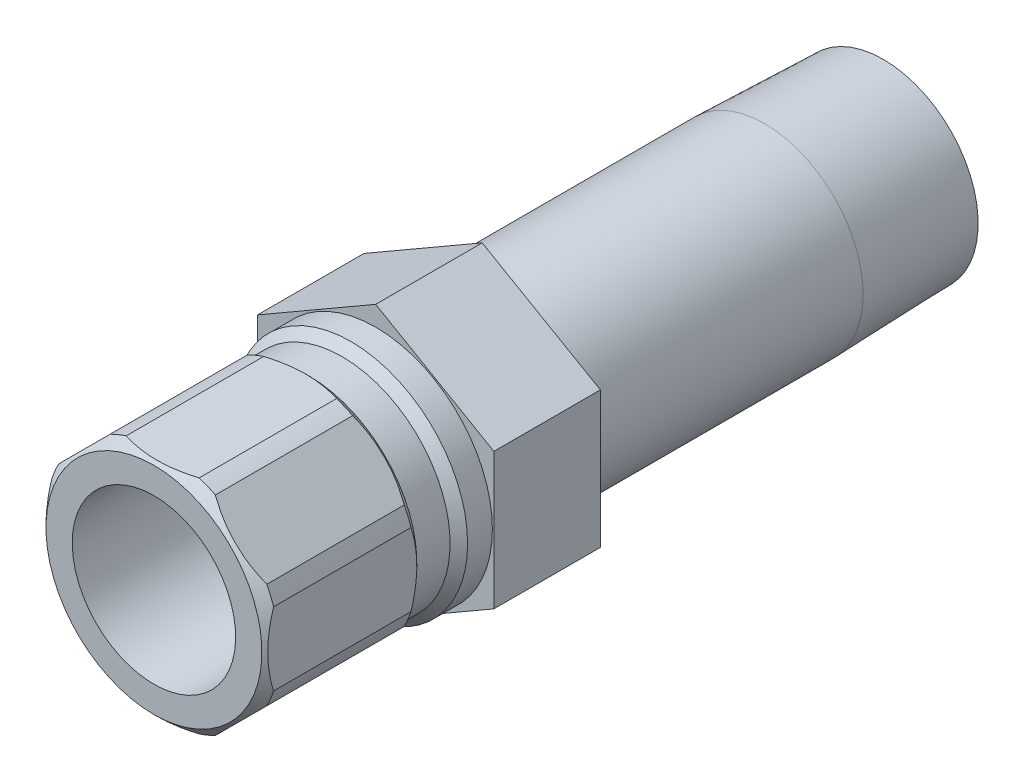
ISO-10303-21;
HEADER;
FILE_DESCRIPTION(('STEP AP214'),'2;1');
FILE_NAME('part.step','',(''),(''),'','','');
FILE_SCHEMA(('AUTOMOTIVE_DESIGN { 1 0 10303 214 1 1 1 1 }'));
ENDSEC;
DATA;
#1=APPLICATION_CONTEXT('core data for automotive mechanical design processes');
#2=APPLICATION_PROTOCOL_DEFINITION('international standard','automotive_design',2000,#1);
#3=PRODUCT_CONTEXT('',#1,'mechanical');
#4=PRODUCT('Part','Part','',(#3));
#5=PRODUCT_RELATED_PRODUCT_CATEGORY('part','',(#4));
#6=PRODUCT_DEFINITION_FORMATION('','',#4);
#7=PRODUCT_DEFINITION_CONTEXT('part definition',#1,'design');
#8=PRODUCT_DEFINITION('design','',#6,#7);
#9=PRODUCT_DEFINITION_SHAPE('','',#8);
#10=(LENGTH_UNIT() NAMED_UNIT(*) SI_UNIT(.MILLI.,.METRE.));
#11=(NAMED_UNIT(*) PLANE_ANGLE_UNIT() SI_UNIT($,.RADIAN.));
#12=(NAMED_UNIT(*) SI_UNIT($,.STERADIAN.) SOLID_ANGLE_UNIT());
#13=UNCERTAINTY_MEASURE_WITH_UNIT(LENGTH_MEASURE(1.E-05),#10,'distance_accuracy_value','');
#14=(GEOMETRIC_REPRESENTATION_CONTEXT(3) GLOBAL_UNCERTAINTY_ASSIGNED_CONTEXT((#13)) GLOBAL_UNIT_ASSIGNED_CONTEXT((#10,
#11,#12)) REPRESENTATION_CONTEXT('',''));
#15=CARTESIAN_POINT('',(0.,0.,0.));
#16=DIRECTION('',(0.,0.,1.));
#17=DIRECTION('',(1.,0.,0.));
#18=AXIS2_PLACEMENT_3D('',#15,#16,#17);
#19=CARTESIAN_POINT('',(0.,0.,0.));
#20=DIRECTION('',(0.,0.,-1.));
#21=DIRECTION('',(0.,1.,0.));
#22=AXIS2_PLACEMENT_3D('',#19,#20,#21);
#23=CYLINDRICAL_SURFACE('',#22,10.16);
#24=DIRECTION('',(0.,0.,-1.));
#25=VECTOR('',#24,1.);
#26=CARTESIAN_POINT('',(9.06826191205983,-4.58172739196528,0.));
#27=LINE('',#26,#25);
#28=CARTESIAN_POINT('',(9.06826191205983,-4.58172739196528,6.5786));
#29=VERTEX_POINT('',#28);
#30=CARTESIAN_POINT('',(9.06826191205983,-4.58172739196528,18.542));
#31=VERTEX_POINT('',#30);
#32=EDGE_CURVE('E525',#29,#31,#27,.F.);
#33=ORIENTED_EDGE('',*,*,#32,.F.);
#34=CARTESIAN_POINT('',(0.,0.,6.5786));
#35=DIRECTION('',(0.,0.,-1.));
#36=DIRECTION('',(0.,1.,0.));
#37=AXIS2_PLACEMENT_3D('',#34,#35,#36);
#38=CIRCLE('',#37,10.16);
#39=CARTESIAN_POINT('',(9.652,-3.17245898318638,6.5786));
#40=VERTEX_POINT('',#39);
#41=EDGE_CURVE('E216',#40,#29,#38,.T.);
#42=ORIENTED_EDGE('',*,*,#41,.F.);
#43=DIRECTION('',(0.,0.,-1.));
#44=VECTOR('',#43,1.);
#45=CARTESIAN_POINT('',(9.652,-3.17245898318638,0.));
#46=LINE('',#45,#44);
#47=CARTESIAN_POINT('',(9.652,-3.17245898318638,18.542));
#48=VERTEX_POINT('',#47);
#49=EDGE_CURVE('E404',#48,#40,#46,.T.);
#50=ORIENTED_EDGE('',*,*,#49,.F.);
#51=CARTESIAN_POINT('',(0.,0.,18.542));
#52=DIRECTION('',(0.,0.,-1.));
#53=DIRECTION('',(0.,1.,0.));
#54=AXIS2_PLACEMENT_3D('',#51,#52,#53);
#55=CIRCLE('',#54,10.16);
#56=EDGE_CURVE('E418',#48,#31,#55,.T.);
#57=ORIENTED_EDGE('',*,*,#56,.T.);
#58=EDGE_LOOP('',(#33,#42,#50,#57));
#59=FACE_BOUND('',#58,.T.);
#60=ADVANCED_FACE('F36',(#59),#23,.T.);
#61=DIRECTION('',(0.,0.,-1.));
#62=VECTOR('',#61,1.);
#63=CARTESIAN_POINT('',(9.652,3.17245898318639,0.));
#64=LINE('',#63,#62);
#65=CARTESIAN_POINT('',(9.652,3.1724589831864,6.57859999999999));
#66=VERTEX_POINT('',#65);
#67=CARTESIAN_POINT('',(9.652,3.17245898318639,18.542));
#68=VERTEX_POINT('',#67);
#69=EDGE_CURVE('E325',#66,#68,#64,.F.);
#70=ORIENTED_EDGE('',*,*,#69,.F.);
#71=CARTESIAN_POINT('',(9.06826191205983,4.58172739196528,6.5786));
#72=VERTEX_POINT('',#71);
#73=EDGE_CURVE('E219',#72,#66,#38,.T.);
#74=ORIENTED_EDGE('',*,*,#73,.F.);
#75=DIRECTION('',(0.,0.,-1.));
#76=VECTOR('',#75,1.);
#77=CARTESIAN_POINT('',(9.06826191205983,4.58172739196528,0.));
#78=LINE('',#77,#76);
#79=CARTESIAN_POINT('',(9.06826191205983,4.58172739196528,18.542));
#80=VERTEX_POINT('',#79);
#81=EDGE_CURVE('E397',#80,#72,#78,.T.);
#82=ORIENTED_EDGE('',*,*,#81,.F.);
#83=EDGE_CURVE('E233',#80,#68,#55,.T.);
#84=ORIENTED_EDGE('',*,*,#83,.T.);
#85=EDGE_LOOP('',(#70,#74,#82,#84));
#86=FACE_BOUND('',#85,.T.);
#87=ADVANCED_FACE('F419',(#86),#23,.T.);
#88=DIRECTION('',(0.,0.,-1.));
#89=VECTOR('',#88,1.);
#90=CARTESIAN_POINT('',(4.58172739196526,9.06826191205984,0.));
#91=LINE('',#90,#89);
#92=CARTESIAN_POINT('',(4.58172739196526,9.06826191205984,6.5786));
#93=VERTEX_POINT('',#92);
#94=CARTESIAN_POINT('',(4.58172739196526,9.06826191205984,18.542));
#95=VERTEX_POINT('',#94);
#96=EDGE_CURVE('E398',#93,#95,#91,.F.);
#97=ORIENTED_EDGE('',*,*,#96,.F.);
#98=CARTESIAN_POINT('',(3.17245898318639,9.652,6.5786));
#99=VERTEX_POINT('',#98);
#100=EDGE_CURVE('E221',#99,#93,#38,.T.);
#101=ORIENTED_EDGE('',*,*,#100,.F.);
#102=DIRECTION('',(0.,0.,-1.));
#103=VECTOR('',#102,1.);
#104=CARTESIAN_POINT('',(3.17245898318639,9.652,0.));
#105=LINE('',#104,#103);
#106=CARTESIAN_POINT('',(3.17245898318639,9.652,18.542));
#107=VERTEX_POINT('',#106);
#108=EDGE_CURVE('E391',#107,#99,#105,.T.);
#109=ORIENTED_EDGE('',*,*,#108,.F.);
#110=EDGE_CURVE('E229',#107,#95,#55,.T.);
#111=ORIENTED_EDGE('',*,*,#110,.T.);
#112=EDGE_LOOP('',(#97,#101,#109,#111));
#113=FACE_BOUND('',#112,.T.);
#114=ADVANCED_FACE('F438',(#113),#23,.T.);
#115=DIRECTION('',(0.,0.,-1.));
#116=VECTOR('',#115,1.);
#117=CARTESIAN_POINT('',(-3.17245898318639,9.652,0.));
#118=LINE('',#117,#116);
#119=CARTESIAN_POINT('',(-3.17245898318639,9.652,6.5786));
#120=VERTEX_POINT('',#119);
#121=CARTESIAN_POINT('',(-3.17245898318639,9.652,18.542));
#122=VERTEX_POINT('',#121);
#123=EDGE_CURVE('E392',#120,#122,#118,.F.);
#124=ORIENTED_EDGE('',*,*,#123,.F.);
#125=CARTESIAN_POINT('',(-4.58172739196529,9.06826191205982,6.5786));
#126=VERTEX_POINT('',#125);
#127=EDGE_CURVE('E226',#126,#120,#38,.T.);
#128=ORIENTED_EDGE('',*,*,#127,.F.);
#129=DIRECTION('',(0.,0.,-1.));
#130=VECTOR('',#129,1.);
#131=CARTESIAN_POINT('',(-4.58172739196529,9.06826191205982,0.));
#132=LINE('',#131,#130);
#133=CARTESIAN_POINT('',(-4.58172739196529,9.06826191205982,18.542));
#134=VERTEX_POINT('',#133);
#135=EDGE_CURVE('E56',#134,#126,#132,.T.);
#136=ORIENTED_EDGE('',*,*,#135,.F.);
#137=EDGE_CURVE('E225',#134,#122,#55,.T.);
#138=ORIENTED_EDGE('',*,*,#137,.T.);
#139=EDGE_LOOP('',(#124,#128,#136,#138));
#140=FACE_BOUND('',#139,.T.);
#141=ADVANCED_FACE('F433',(#140),#23,.T.);
#142=DIRECTION('',(0.,0.,-1.));
#143=VECTOR('',#142,1.);
#144=CARTESIAN_POINT('',(-9.06826191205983,4.58172739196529,0.));
#145=LINE('',#144,#143);
#146=CARTESIAN_POINT('',(-9.06826191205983,4.58172739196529,6.5786));
#147=VERTEX_POINT('',#146);
#148=CARTESIAN_POINT('',(-9.06826191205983,4.58172739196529,18.542));
#149=VERTEX_POINT('',#148);
#150=EDGE_CURVE('E388',#147,#149,#145,.F.);
#151=ORIENTED_EDGE('',*,*,#150,.F.);
#152=CARTESIAN_POINT('',(-9.652,3.17245898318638,6.5786));
#153=VERTEX_POINT('',#152);
#154=EDGE_CURVE('E441',#153,#147,#38,.T.);
#155=ORIENTED_EDGE('',*,*,#154,.F.);
#156=DIRECTION('',(0.,0.,-1.));
#157=VECTOR('',#156,1.);
#158=CARTESIAN_POINT('',(-9.652,3.17245898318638,0.));
#159=LINE('',#158,#157);
#160=CARTESIAN_POINT('',(-9.652,3.17245898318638,18.542));
#161=VERTEX_POINT('',#160);
#162=EDGE_CURVE('E64',#161,#153,#159,.T.);
#163=ORIENTED_EDGE('',*,*,#162,.F.);
#164=EDGE_CURVE('E424',#161,#149,#55,.T.);
#165=ORIENTED_EDGE('',*,*,#164,.T.);
#166=EDGE_LOOP('',(#151,#155,#163,#165));
#167=FACE_BOUND('',#166,.T.);
#168=ADVANCED_FACE('F546',(#167),#23,.T.);
#169=DIRECTION('',(0.,0.,-1.));
#170=VECTOR('',#169,1.);
#171=CARTESIAN_POINT('',(-9.652,-3.17245898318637,0.));
#172=LINE('',#171,#170);
#173=CARTESIAN_POINT('',(-9.652,-3.17245898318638,6.5786));
#174=VERTEX_POINT('',#173);
#175=CARTESIAN_POINT('',(-9.652,-3.17245898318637,18.542));
#176=VERTEX_POINT('',#175);
#177=EDGE_CURVE('E386',#174,#176,#172,.F.);
#178=ORIENTED_EDGE('',*,*,#177,.F.);
#179=CARTESIAN_POINT('',(-9.06826191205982,-4.58172739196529,6.5786));
#180=VERTEX_POINT('',#179);
#181=EDGE_CURVE('E220',#180,#174,#38,.T.);
#182=ORIENTED_EDGE('',*,*,#181,.F.);
#183=DIRECTION('',(0.,0.,-1.));
#184=VECTOR('',#183,1.);
#185=CARTESIAN_POINT('',(-9.06826191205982,-4.58172739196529,0.));
#186=LINE('',#185,#184);
#187=CARTESIAN_POINT('',(-9.06826191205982,-4.58172739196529,18.542));
#188=VERTEX_POINT('',#187);
#189=EDGE_CURVE('E263',#188,#180,#186,.T.);
#190=ORIENTED_EDGE('',*,*,#189,.F.);
#191=EDGE_CURVE('E422',#188,#176,#55,.T.);
#192=ORIENTED_EDGE('',*,*,#191,.T.);
#193=EDGE_LOOP('',(#178,#182,#190,#192));
#194=FACE_BOUND('',#193,.T.);
#195=ADVANCED_FACE('F539',(#194),#23,.T.);
#196=DIRECTION('',(0.,0.,-1.));
#197=VECTOR('',#196,1.);
#198=CARTESIAN_POINT('',(-4.58172739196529,-9.06826191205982,0.));
#199=LINE('',#198,#197);
#200=CARTESIAN_POINT('',(-4.58172739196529,-9.06826191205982,6.5786));
#201=VERTEX_POINT('',#200);
#202=CARTESIAN_POINT('',(-4.58172739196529,-9.06826191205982,18.542));
#203=VERTEX_POINT('',#202);
#204=EDGE_CURVE('E376',#201,#203,#199,.F.);
#205=ORIENTED_EDGE('',*,*,#204,.F.);
#206=CARTESIAN_POINT('',(-3.17245898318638,-9.652,6.5786));
#207=VERTEX_POINT('',#206);
#208=EDGE_CURVE('E217',#207,#201,#38,.T.);
#209=ORIENTED_EDGE('',*,*,#208,.F.);
#210=DIRECTION('',(0.,0.,-1.));
#211=VECTOR('',#210,1.);
#212=CARTESIAN_POINT('',(-3.17245898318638,-9.652,0.));
#213=LINE('',#212,#211);
#214=CARTESIAN_POINT('',(-3.17245898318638,-9.652,18.542));
#215=VERTEX_POINT('',#214);
#216=EDGE_CURVE('E194',#215,#207,#213,.T.);
#217=ORIENTED_EDGE('',*,*,#216,.F.);
#218=EDGE_CURVE('E385',#215,#203,#55,.T.);
#219=ORIENTED_EDGE('',*,*,#218,.T.);
#220=EDGE_LOOP('',(#205,#209,#217,#219));
#221=FACE_BOUND('',#220,.T.);
#222=ADVANCED_FACE('F383',(#221),#23,.T.);
#223=CARTESIAN_POINT('',(0.,0.,0.));
#224=DIRECTION('',(0.,0.,-1.));
#225=DIRECTION('',(0.,1.,0.));
#226=AXIS2_PLACEMENT_3D('',#223,#224,#225);
#227=CYLINDRICAL_SURFACE('',#226,8.5725);
#228=CARTESIAN_POINT('',(0.,0.,-33.8582));
#229=DIRECTION('',(0.,0.,-1.));
#230=DIRECTION('',(0.,1.,0.));
#231=AXIS2_PLACEMENT_3D('',#228,#229,#230);
#232=CIRCLE('',#231,8.5725);
#233=CARTESIAN_POINT('',(0.,8.5725,-33.8582));
#234=VERTEX_POINT('',#233);
#235=EDGE_CURVE('E456',#234,#234,#232,.T.);
#236=ORIENTED_EDGE('',*,*,#235,.F.);
#237=EDGE_LOOP('',(#236));
#238=FACE_BOUND('',#237,.T.);
#239=CARTESIAN_POINT('',(0.,0.,-9.271));
#240=DIRECTION('',(0.,0.,1.));
#241=DIRECTION('',(1.,0.,0.));
#242=AXIS2_PLACEMENT_3D('',#239,#240,#241);
#243=CIRCLE('',#242,8.5725);
#244=CARTESIAN_POINT('',(8.5725,0.,-9.271));
#245=VERTEX_POINT('',#244);
#246=EDGE_CURVE('E471',#245,#245,#243,.F.);
#247=ORIENTED_EDGE('',*,*,#246,.T.);
#248=EDGE_LOOP('',(#247));
#249=FACE_BOUND('',#248,.T.);
#250=ADVANCED_FACE('F538',(#238,#249),#227,.T.);
#251=CARTESIAN_POINT('',(0.,0.,0.));
#252=DIRECTION('',(0.,0.,-1.));
#253=DIRECTION('',(0.,1.,0.));
#254=AXIS2_PLACEMENT_3D('',#251,#252,#253);
#255=CYLINDRICAL_SURFACE('',#254,7.112);
#256=CARTESIAN_POINT('',(0.,0.,1.524));
#257=DIRECTION('',(0.,0.,-1.));
#258=DIRECTION('',(0.,1.,0.));
#259=AXIS2_PLACEMENT_3D('',#256,#257,#258);
#260=CIRCLE('',#259,7.112);
#261=CARTESIAN_POINT('',(0.,7.112,1.524));
#262=VERTEX_POINT('',#261);
#263=EDGE_CURVE('E468',#262,#262,#260,.T.);
#264=ORIENTED_EDGE('',*,*,#263,.T.);
#265=EDGE_LOOP('',(#264));
#266=FACE_BOUND('',#265,.T.);
#267=CARTESIAN_POINT('',(0.,0.,19.304));
#268=DIRECTION('',(0.,0.,-1.));
#269=DIRECTION('',(0.,1.,0.));
#270=AXIS2_PLACEMENT_3D('',#267,#268,#269);
#271=CIRCLE('',#270,7.112);
#272=CARTESIAN_POINT('',(0.,7.112,19.304));
#273=VERTEX_POINT('',#272);
#274=EDGE_CURVE('E200',#273,#273,#271,.T.);
#275=ORIENTED_EDGE('',*,*,#274,.F.);
#276=EDGE_LOOP('',(#275));
#277=FACE_BOUND('',#276,.T.);
#278=ADVANCED_FACE('F38',(#266,#277),#255,.F.);
#279=CARTESIAN_POINT('',(0.,7.112,19.304));
#280=DIRECTION('',(0.,0.,1.));
#281=DIRECTION('',(0.,-1.,0.));
#282=AXIS2_PLACEMENT_3D('',#279,#280,#281);
#283=PLANE('',#282);
#284=ORIENTED_EDGE('',*,*,#274,.T.);
#285=EDGE_LOOP('',(#284));
#286=FACE_BOUND('',#285,.T.);
#287=CARTESIAN_POINT('',(0.,0.,19.304));
#288=DIRECTION('',(0.,0.,-1.));
#289=DIRECTION('',(0.,1.,0.));
#290=AXIS2_PLACEMENT_3D('',#287,#288,#289);
#291=CIRCLE('',#290,9.398);
#292=CARTESIAN_POINT('',(0.,9.398,19.304));
#293=VERTEX_POINT('',#292);
#294=EDGE_CURVE('E232',#293,#293,#291,.T.);
#295=ORIENTED_EDGE('',*,*,#294,.F.);
#296=EDGE_LOOP('',(#295));
#297=FACE_BOUND('',#296,.T.);
#298=ADVANCED_FACE('F269',(#286,#297),#283,.T.);
#299=CARTESIAN_POINT('',(0.,0.,18.542));
#300=DIRECTION('',(0.,0.,-1.));
#301=DIRECTION('',(0.,1.,0.));
#302=AXIS2_PLACEMENT_3D('',#299,#300,#301);
#303=CONICAL_SURFACE('',#302,10.16,0.785398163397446);
#304=CARTESIAN_POINT('',(9.06871478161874,-4.58127452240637,18.5418));
#305=CARTESIAN_POINT('',(8.89746651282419,-4.75252279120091,18.6174888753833));
#306=CARTESIAN_POINT('',(8.72454398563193,-4.92544531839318,18.6860001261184));
#307=CARTESIAN_POINT('',(8.37571487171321,-5.2742744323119,18.8068689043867));
#308=CARTESIAN_POINT('',(8.19980528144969,-5.45018402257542,18.85920901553));
#309=CARTESIAN_POINT('',(7.8498282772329,-5.80016102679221,18.9447662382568));
#310=CARTESIAN_POINT('',(7.67581225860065,-5.97417704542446,18.9783973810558));
#311=CARTESIAN_POINT('',(7.32656572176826,-6.32342358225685,19.0270891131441));
#312=CARTESIAN_POINT('',(7.15133584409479,-6.49865345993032,19.0421588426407));
#313=CARTESIAN_POINT('',(6.77605057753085,-6.87393872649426,19.0538859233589));
#314=CARTESIAN_POINT('',(6.57594647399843,-7.07404283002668,19.0476773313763));
#315=CARTESIAN_POINT('',(6.17675989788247,-7.47322940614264,19.0106603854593));
#316=CARTESIAN_POINT('',(5.97767829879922,-7.67231100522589,18.9798336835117));
#317=CARTESIAN_POINT('',(5.57666706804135,-8.07332223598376,18.8939894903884));
#318=CARTESIAN_POINT('',(5.37480504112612,-8.27518426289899,18.8383431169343));
#319=CARTESIAN_POINT('',(5.07491153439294,-8.57507776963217,18.7386783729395));
#320=CARTESIAN_POINT('',(4.97548345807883,-8.67450584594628,18.7027814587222));
#321=CARTESIAN_POINT('',(4.77762502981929,-8.87236427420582,18.6259657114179));
#322=CARTESIAN_POINT('',(4.67919445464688,-8.97079484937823,18.5850480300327));
#323=CARTESIAN_POINT('',(4.58127452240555,-9.06871478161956,18.5417999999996));
#324=B_SPLINE_CURVE_WITH_KNOTS('',3,(#304,#305,#306,#307,#308,#309,#310,#311,#312,#313,#314,
#315,#316,#317,#318,#319,#320,#321,#322,#323),.UNSPECIFIED.,.F.,.F.,(4,2,2,2,2,2,2,2,2,4),(0.,
0.761268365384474,1.52335378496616,2.26782503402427,3.01192953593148,3.85997332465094,
4.70864975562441,5.58017277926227,6.01546212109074,6.4506517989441),.UNSPECIFIED.);
#325=CARTESIAN_POINT('',(4.58172739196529,-9.06826191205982,18.542));
#326=VERTEX_POINT('',#325);
#327=EDGE_CURVE('E506',#31,#326,#324,.T.);
#328=ORIENTED_EDGE('',*,*,#327,.F.);
#329=ORIENTED_EDGE('',*,*,#56,.F.);
#330=CARTESIAN_POINT('',(9.652,-7.71050187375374,16.3483388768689));
#331=CARTESIAN_POINT('',(9.652,-7.52475481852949,16.4642553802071));
#332=CARTESIAN_POINT('',(9.652,-7.33786285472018,16.5783624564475));
#333=CARTESIAN_POINT('',(9.652,-6.96152272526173,16.8023812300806));
#334=CARTESIAN_POINT('',(9.652,-6.77207395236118,16.9122919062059));
#335=CARTESIAN_POINT('',(9.652,-6.38961701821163,17.1277502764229));
#336=CARTESIAN_POINT('',(9.652,-6.19659699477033,17.2332770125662));
#337=CARTESIAN_POINT('',(9.652,-5.80760245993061,17.4386922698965));
#338=CARTESIAN_POINT('',(9.652,-5.6116281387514,17.5385811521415));
#339=CARTESIAN_POINT('',(9.652,-5.01021259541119,17.8328232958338));
#340=CARTESIAN_POINT('',(9.652,-4.59965798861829,18.0169416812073));
#341=CARTESIAN_POINT('',(9.652,-3.76461195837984,18.3488686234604));
#342=CARTESIAN_POINT('',(9.652,-3.34014745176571,18.4967430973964));
#343=CARTESIAN_POINT('',(9.652,-2.66836152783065,18.6905975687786));
#344=CARTESIAN_POINT('',(9.652,-2.42567962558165,18.7527238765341));
#345=CARTESIAN_POINT('',(9.652,-1.9366245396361,18.860517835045));
#346=CARTESIAN_POINT('',(9.652,-1.69025117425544,18.9061846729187));
#347=CARTESIAN_POINT('',(9.652,-1.1971622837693,18.9790662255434));
#348=CARTESIAN_POINT('',(9.652,-0.95047238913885,19.0064526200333));
#349=CARTESIAN_POINT('',(9.652,-0.45571021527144,19.0423990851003));
#350=CARTESIAN_POINT('',(9.652,-0.207637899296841,19.0509586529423));
#351=CARTESIAN_POINT('',(9.652,0.333683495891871,19.048681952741));
#352=CARTESIAN_POINT('',(9.652,0.626923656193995,19.0340251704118));
#353=CARTESIAN_POINT('',(9.652,1.21094277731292,18.9786837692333));
#354=CARTESIAN_POINT('',(9.652,1.501721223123,18.9379938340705));
#355=CARTESIAN_POINT('',(9.652,2.08266136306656,18.8320509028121));
#356=CARTESIAN_POINT('',(9.652,2.3727646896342,18.7664820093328));
#357=CARTESIAN_POINT('',(9.652,2.94714147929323,18.6138865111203));
#358=CARTESIAN_POINT('',(9.652,3.23141585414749,18.5268632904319));
#359=CARTESIAN_POINT('',(9.652,3.82869981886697,18.3226103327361));
#360=CARTESIAN_POINT('',(9.652,4.14087760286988,18.2029681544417));
#361=CARTESIAN_POINT('',(9.652,4.75742701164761,17.9448741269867));
#362=CARTESIAN_POINT('',(9.652,5.0617950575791,17.8064138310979));
#363=CARTESIAN_POINT('',(9.652,5.66409479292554,17.5139015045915));
#364=CARTESIAN_POINT('',(9.652,5.96200267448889,17.3598008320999));
#365=CARTESIAN_POINT('',(9.652,6.55107386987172,17.0393844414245));
#366=CARTESIAN_POINT('',(9.652,6.84223818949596,16.8730705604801));
#367=CARTESIAN_POINT('',(9.652,7.40668231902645,16.5376791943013));
#368=CARTESIAN_POINT('',(9.652,7.68020242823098,16.3690040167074));
#369=CARTESIAN_POINT('',(9.652,8.22250898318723,16.0241853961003));
#370=CARTESIAN_POINT('',(9.652,8.49129505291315,15.848041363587));
#371=CARTESIAN_POINT('',(9.652,9.02258177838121,15.4910339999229));
#372=CARTESIAN_POINT('',(9.652,9.28511552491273,15.3102197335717));
#373=CARTESIAN_POINT('',(9.652,9.80652727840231,14.9435456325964));
#374=CARTESIAN_POINT('',(9.652,10.0654063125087,14.7576872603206));
#375=CARTESIAN_POINT('',(9.652,10.3227473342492,14.5697596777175));
#376=B_SPLINE_CURVE_WITH_KNOTS('',3,(#330,#331,#332,#333,#334,#335,#336,#337,#338,#339,#340,
#341,#342,#343,#344,#345,#346,#347,#348,#349,#350,#351,#352,#353,#354,#355,#356,#357,#358,#359,
#360,#361,#362,#363,#364,#365,#366,#367,#368,#369,#370,#371,#372,#373,#374,#375),.UNSPECIFIED.,
.F.,.F.,(4,2,2,2,2,2,2,2,2,2,2,2,2,2,2,2,2,2,2,2,2,2,4),(0.,0.656855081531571,1.31386901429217,
1.97372850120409,2.63354568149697,3.98211483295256,5.32821282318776,6.07925616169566,
6.83033658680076,7.5742601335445,8.31820354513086,9.1977741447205,10.0775244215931,
10.9688407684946,11.8600166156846,12.8622077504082,13.8648502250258,14.8707124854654,
15.8764237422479,16.8403261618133,17.8043048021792,18.7605668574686,19.7165545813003),.UNSPECIFIED.);
#377=EDGE_CURVE('E317',#68,#48,#376,.F.);
#378=ORIENTED_EDGE('',*,*,#377,.F.);
#379=ORIENTED_EDGE('',*,*,#83,.F.);
#380=CARTESIAN_POINT('',(4.58127452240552,9.06871478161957,18.5417999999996));
#381=CARTESIAN_POINT('',(4.75252279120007,8.89746651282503,18.617488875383));
#382=CARTESIAN_POINT('',(4.92544531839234,8.72454398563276,18.6860001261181));
#383=CARTESIAN_POINT('',(5.27427443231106,8.37571487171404,18.8068689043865));
#384=CARTESIAN_POINT('',(5.45018402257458,8.19980528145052,18.8592090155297));
#385=CARTESIAN_POINT('',(5.80016102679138,7.84982827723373,18.9447662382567));
#386=CARTESIAN_POINT('',(5.97417704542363,7.67581225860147,18.9783973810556));
#387=CARTESIAN_POINT('',(6.32342358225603,7.32656572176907,19.027089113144));
#388=CARTESIAN_POINT('',(6.4986534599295,7.1513358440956,19.0421588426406));
#389=CARTESIAN_POINT('',(6.87393872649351,6.77605057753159,19.0538859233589));
#390=CARTESIAN_POINT('',(7.074042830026,6.57594647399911,19.0476773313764));
#391=CARTESIAN_POINT('',(7.4732294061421,6.17675989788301,19.0106603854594));
#392=CARTESIAN_POINT('',(7.67231100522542,5.97767829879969,18.9798336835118));
#393=CARTESIAN_POINT('',(8.07332223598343,5.57666706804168,18.8939894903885));
#394=CARTESIAN_POINT('',(8.27518426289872,5.37480504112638,18.8383431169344));
#395=CARTESIAN_POINT('',(8.57507776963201,5.07491153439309,18.7386783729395));
#396=CARTESIAN_POINT('',(8.67450584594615,4.97548345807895,18.7027814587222));
#397=CARTESIAN_POINT('',(8.87236427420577,4.77762502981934,18.6259657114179));
#398=CARTESIAN_POINT('',(8.9707948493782,4.6791944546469,18.5850480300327));
#399=CARTESIAN_POINT('',(9.06871478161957,4.58127452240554,18.5417999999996));
#400=B_SPLINE_CURVE_WITH_KNOTS('',3,(#380,#381,#382,#383,#384,#385,#386,#387,#388,#389,#390,
#391,#392,#393,#394,#395,#396,#397,#398,#399),.UNSPECIFIED.,.F.,.F.,(4,2,2,2,2,2,2,2,2,4),(0.,
0.761268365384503,1.52335378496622,2.26782503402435,3.01192953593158,3.85997332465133,
4.70864975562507,5.58017277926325,6.01546212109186,6.45065179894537),.UNSPECIFIED.);
#401=EDGE_CURVE('E309',#95,#80,#400,.T.);
#402=ORIENTED_EDGE('',*,*,#401,.F.);
#403=ORIENTED_EDGE('',*,*,#110,.F.);
#404=CARTESIAN_POINT('',(-7.71050187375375,9.652,16.3483388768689));
#405=CARTESIAN_POINT('',(-7.5247548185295,9.652,16.4642553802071));
#406=CARTESIAN_POINT('',(-7.33786285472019,9.652,16.5783624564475));
#407=CARTESIAN_POINT('',(-6.96152272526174,9.652,16.8023812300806));
#408=CARTESIAN_POINT('',(-6.77207395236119,9.652,16.9122919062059));
#409=CARTESIAN_POINT('',(-6.38961701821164,9.652,17.1277502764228));
#410=CARTESIAN_POINT('',(-6.19659699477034,9.652,17.2332770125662));
#411=CARTESIAN_POINT('',(-5.80760245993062,9.652,17.4386922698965));
#412=CARTESIAN_POINT('',(-5.61162813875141,9.652,17.5385811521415));
#413=CARTESIAN_POINT('',(-5.0102125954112,9.652,17.8328232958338));
#414=CARTESIAN_POINT('',(-4.5996579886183,9.652,18.0169416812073));
#415=CARTESIAN_POINT('',(-3.76461195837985,9.652,18.3488686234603));
#416=CARTESIAN_POINT('',(-3.34014745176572,9.652,18.4967430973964));
#417=CARTESIAN_POINT('',(-2.66836152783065,9.652,18.6905975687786));
#418=CARTESIAN_POINT('',(-2.42567962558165,9.652,18.7527238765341));
#419=CARTESIAN_POINT('',(-1.9366245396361,9.652,18.860517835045));
#420=CARTESIAN_POINT('',(-1.69025117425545,9.652,18.9061846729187));
#421=CARTESIAN_POINT('',(-1.19716228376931,9.652,18.9790662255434));
#422=CARTESIAN_POINT('',(-0.950472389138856,9.652,19.0064526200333));
#423=CARTESIAN_POINT('',(-0.455710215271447,9.652,19.0423990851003));
#424=CARTESIAN_POINT('',(-0.207637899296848,9.652,19.0509586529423));
#425=CARTESIAN_POINT('',(0.333683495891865,9.652,19.048681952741));
#426=CARTESIAN_POINT('',(0.626923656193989,9.652,19.0340251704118));
#427=CARTESIAN_POINT('',(1.21094277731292,9.652,18.9786837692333));
#428=CARTESIAN_POINT('',(1.50172122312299,9.652,18.9379938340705));
#429=CARTESIAN_POINT('',(2.08266136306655,9.652,18.8320509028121));
#430=CARTESIAN_POINT('',(2.3727646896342,9.652,18.7664820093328));
#431=CARTESIAN_POINT('',(2.94714147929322,9.652,18.6138865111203));
#432=CARTESIAN_POINT('',(3.23141585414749,9.652,18.5268632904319));
#433=CARTESIAN_POINT('',(3.82869981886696,9.652,18.3226103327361));
#434=CARTESIAN_POINT('',(4.14087760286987,9.652,18.2029681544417));
#435=CARTESIAN_POINT('',(4.7574270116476,9.652,17.9448741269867));
#436=CARTESIAN_POINT('',(5.06179505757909,9.652,17.8064138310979));
#437=CARTESIAN_POINT('',(5.66409479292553,9.652,17.5139015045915));
#438=CARTESIAN_POINT('',(5.96200267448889,9.652,17.3598008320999));
#439=CARTESIAN_POINT('',(6.55107386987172,9.652,17.0393844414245));
#440=CARTESIAN_POINT('',(6.84223818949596,9.652,16.8730705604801));
#441=CARTESIAN_POINT('',(7.40668231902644,9.652,16.5376791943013));
#442=CARTESIAN_POINT('',(7.68020242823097,9.652,16.3690040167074));
#443=CARTESIAN_POINT('',(8.22250898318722,9.652,16.0241853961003));
#444=CARTESIAN_POINT('',(8.49129505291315,9.652,15.848041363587));
#445=CARTESIAN_POINT('',(9.0225817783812,9.652,15.4910339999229));
#446=CARTESIAN_POINT('',(9.28511552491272,9.652,15.3102197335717));
#447=CARTESIAN_POINT('',(9.8065272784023,9.652,14.9435456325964));
#448=CARTESIAN_POINT('',(10.0654063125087,9.652,14.7576872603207));
#449=CARTESIAN_POINT('',(10.3227473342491,9.652,14.5697596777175));
#450=B_SPLINE_CURVE_WITH_KNOTS('',3,(#404,#405,#406,#407,#408,#409,#410,#411,#412,#413,#414,
#415,#416,#417,#418,#419,#420,#421,#422,#423,#424,#425,#426,#427,#428,#429,#430,#431,#432,#433,
#434,#435,#436,#437,#438,#439,#440,#441,#442,#443,#444,#445,#446,#447,#448,#449),.UNSPECIFIED.,
.F.,.F.,(4,2,2,2,2,2,2,2,2,2,2,2,2,2,2,2,2,2,2,2,2,2,4),(0.,0.656855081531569,1.31386901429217,
1.97372850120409,2.63354568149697,3.98211483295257,5.32821282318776,6.07925616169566,
6.83033658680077,7.57426013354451,8.31820354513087,9.1977741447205,10.0775244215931,
10.9688407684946,11.8600166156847,12.8622077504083,13.8648502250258,14.8707124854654,
15.8764237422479,16.8403261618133,17.8043048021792,18.7605668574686,19.7165545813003),.UNSPECIFIED.);
#451=EDGE_CURVE('E301',#122,#107,#450,.T.);
#452=ORIENTED_EDGE('',*,*,#451,.F.);
#453=ORIENTED_EDGE('',*,*,#137,.F.);
#454=CARTESIAN_POINT('',(-9.06871478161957,4.58127452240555,18.5417999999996));
#455=CARTESIAN_POINT('',(-8.89746651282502,4.75252279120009,18.617488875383));
#456=CARTESIAN_POINT('',(-8.72454398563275,4.92544531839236,18.6860001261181));
#457=CARTESIAN_POINT('',(-8.37571487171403,5.27427443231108,18.8068689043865));
#458=CARTESIAN_POINT('',(-8.19980528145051,5.4501840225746,18.8592090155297));
#459=CARTESIAN_POINT('',(-7.84982827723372,5.80016102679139,18.9447662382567));
#460=CARTESIAN_POINT('',(-7.67581225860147,5.97417704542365,18.9783973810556));
#461=CARTESIAN_POINT('',(-7.32656572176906,6.32342358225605,19.027089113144));
#462=CARTESIAN_POINT('',(-7.15133584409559,6.49865345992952,19.0421588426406));
#463=CARTESIAN_POINT('',(-6.77605057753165,6.87393872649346,19.0538859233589));
#464=CARTESIAN_POINT('',(-6.57594647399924,7.07404283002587,19.0476773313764));
#465=CARTESIAN_POINT('',(-6.17675989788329,7.47322940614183,19.0106603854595));
#466=CARTESIAN_POINT('',(-5.97767829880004,7.67231100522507,18.9798336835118));
#467=CARTESIAN_POINT('',(-5.57666706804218,8.07332223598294,18.8939894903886));
#468=CARTESIAN_POINT('',(-5.37480504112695,8.27518426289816,18.8383431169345));
#469=CARTESIAN_POINT('',(-5.07491153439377,8.57507776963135,18.7386783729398));
#470=CARTESIAN_POINT('',(-4.97548345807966,8.67450584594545,18.7027814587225));
#471=CARTESIAN_POINT('',(-4.77762502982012,8.872364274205,18.6259657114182));
#472=CARTESIAN_POINT('',(-4.67919445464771,8.9707948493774,18.585048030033));
#473=CARTESIAN_POINT('',(-4.58127452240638,9.06871478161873,18.5418));
#474=B_SPLINE_CURVE_WITH_KNOTS('',3,(#454,#455,#456,#457,#458,#459,#460,#461,#462,#463,#464,
#465,#466,#467,#468,#469,#470,#471,#472,#473),.UNSPECIFIED.,.F.,.F.,(4,2,2,2,2,2,2,2,2,4),(0.,
0.761268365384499,1.52335378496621,2.26782503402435,3.01192953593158,3.85997332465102,
4.70864975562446,5.5801727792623,6.01546212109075,6.4506517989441),.UNSPECIFIED.);
#475=EDGE_CURVE('E292',#149,#134,#474,.T.);
#476=ORIENTED_EDGE('',*,*,#475,.F.);
#477=ORIENTED_EDGE('',*,*,#164,.F.);
#478=CARTESIAN_POINT('',(-9.652,-7.71050187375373,16.3483388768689));
#479=CARTESIAN_POINT('',(-9.652,-7.52475481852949,16.4642553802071));
#480=CARTESIAN_POINT('',(-9.652,-7.33786285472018,16.5783624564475));
#481=CARTESIAN_POINT('',(-9.652,-6.96152272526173,16.8023812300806));
#482=CARTESIAN_POINT('',(-9.652,-6.77207395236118,16.9122919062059));
#483=CARTESIAN_POINT('',(-9.652,-6.38961701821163,17.1277502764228));
#484=CARTESIAN_POINT('',(-9.652,-6.19659699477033,17.2332770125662));
#485=CARTESIAN_POINT('',(-9.652,-5.8076024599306,17.4386922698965));
#486=CARTESIAN_POINT('',(-9.652,-5.6116281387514,17.5385811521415));
#487=CARTESIAN_POINT('',(-9.652,-5.01021259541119,17.8328232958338));
#488=CARTESIAN_POINT('',(-9.652,-4.59965798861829,18.0169416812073));
#489=CARTESIAN_POINT('',(-9.652,-3.76461195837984,18.3488686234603));
#490=CARTESIAN_POINT('',(-9.652,-3.34014745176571,18.4967430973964));
#491=CARTESIAN_POINT('',(-9.652,-2.66836152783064,18.6905975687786));
#492=CARTESIAN_POINT('',(-9.652,-2.42567962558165,18.7527238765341));
#493=CARTESIAN_POINT('',(-9.652,-1.9366245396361,18.860517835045));
#494=CARTESIAN_POINT('',(-9.652,-1.69025117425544,18.9061846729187));
#495=CARTESIAN_POINT('',(-9.652,-1.1971622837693,18.9790662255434));
#496=CARTESIAN_POINT('',(-9.652,-0.950472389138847,19.0064526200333));
#497=CARTESIAN_POINT('',(-9.652,-0.455710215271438,19.0423990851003));
#498=CARTESIAN_POINT('',(-9.652,-0.207637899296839,19.0509586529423));
#499=CARTESIAN_POINT('',(-9.652,0.333683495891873,19.048681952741));
#500=CARTESIAN_POINT('',(-9.652,0.626923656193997,19.0340251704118));
#501=CARTESIAN_POINT('',(-9.652,1.21094277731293,18.9786837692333));
#502=CARTESIAN_POINT('',(-9.652,1.501721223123,18.9379938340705));
#503=CARTESIAN_POINT('',(-9.652,2.08266136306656,18.8320509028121));
#504=CARTESIAN_POINT('',(-9.652,2.3727646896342,18.7664820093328));
#505=CARTESIAN_POINT('',(-9.652,2.94714147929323,18.6138865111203));
#506=CARTESIAN_POINT('',(-9.652,3.23141585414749,18.5268632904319));
#507=CARTESIAN_POINT('',(-9.652,3.82869981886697,18.3226103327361));
#508=CARTESIAN_POINT('',(-9.652,4.14087760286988,18.2029681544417));
#509=CARTESIAN_POINT('',(-9.652,4.75742701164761,17.9448741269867));
#510=CARTESIAN_POINT('',(-9.652,5.0617950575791,17.8064138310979));
#511=CARTESIAN_POINT('',(-9.652,5.66409479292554,17.5139015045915));
#512=CARTESIAN_POINT('',(-9.652,5.9620026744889,17.3598008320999));
#513=CARTESIAN_POINT('',(-9.652,6.55107386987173,17.0393844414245));
#514=CARTESIAN_POINT('',(-9.652,6.84223818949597,16.8730705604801));
#515=CARTESIAN_POINT('',(-9.652,7.40668231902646,16.5376791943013));
#516=CARTESIAN_POINT('',(-9.652,7.68020242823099,16.3690040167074));
#517=CARTESIAN_POINT('',(-9.652,8.22250898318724,16.0241853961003));
#518=CARTESIAN_POINT('',(-9.652,8.49129505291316,15.848041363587));
#519=CARTESIAN_POINT('',(-9.652,9.02258177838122,15.4910339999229));
#520=CARTESIAN_POINT('',(-9.652,9.28511552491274,15.3102197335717));
#521=CARTESIAN_POINT('',(-9.652,9.80652727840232,14.9435456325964));
#522=CARTESIAN_POINT('',(-9.652,10.0654063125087,14.7576872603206));
#523=CARTESIAN_POINT('',(-9.652,10.3227473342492,14.5697596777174));
#524=B_SPLINE_CURVE_WITH_KNOTS('',3,(#478,#479,#480,#481,#482,#483,#484,#485,#486,#487,#488,
#489,#490,#491,#492,#493,#494,#495,#496,#497,#498,#499,#500,#501,#502,#503,#504,#505,#506,#507,
#508,#509,#510,#511,#512,#513,#514,#515,#516,#517,#518,#519,#520,#521,#522,#523),.UNSPECIFIED.,
.F.,.F.,(4,2,2,2,2,2,2,2,2,2,2,2,2,2,2,2,2,2,2,2,2,2,4),(0.,0.656855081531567,1.31386901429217,
1.97372850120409,2.63354568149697,3.98211483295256,5.32821282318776,6.07925616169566,
6.83033658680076,7.5742601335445,8.31820354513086,9.1977741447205,10.0775244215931,
10.9688407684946,11.8600166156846,12.8622077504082,13.8648502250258,14.8707124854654,
15.8764237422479,16.8403261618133,17.8043048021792,18.7605668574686,19.7165545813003),.UNSPECIFIED.);
#525=EDGE_CURVE('E284',#176,#161,#524,.T.);
#526=ORIENTED_EDGE('',*,*,#525,.F.);
#527=ORIENTED_EDGE('',*,*,#191,.F.);
#528=CARTESIAN_POINT('',(-4.58127452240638,-9.06871478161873,18.5418));
#529=CARTESIAN_POINT('',(-4.75252279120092,-8.89746651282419,18.6174888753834));
#530=CARTESIAN_POINT('',(-4.92544531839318,-8.72454398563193,18.6860001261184));
#531=CARTESIAN_POINT('',(-5.2742744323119,-8.37571487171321,18.8068689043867));
#532=CARTESIAN_POINT('',(-5.45018402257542,-8.19980528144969,18.85920901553));
#533=CARTESIAN_POINT('',(-5.80016102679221,-7.8498282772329,18.9447662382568));
#534=CARTESIAN_POINT('',(-5.97417704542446,-7.67581225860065,18.9783973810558));
#535=CARTESIAN_POINT('',(-6.32342358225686,-7.32656572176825,19.0270891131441));
#536=CARTESIAN_POINT('',(-6.49865345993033,-7.15133584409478,19.0421588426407));
#537=CARTESIAN_POINT('',(-6.87393872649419,-6.77605057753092,19.0538859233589));
#538=CARTESIAN_POINT('',(-7.07404283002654,-6.57594647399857,19.0476773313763));
#539=CARTESIAN_POINT('',(-7.47322940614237,-6.17675989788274,19.0106603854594));
#540=CARTESIAN_POINT('',(-7.67231100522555,-5.97767829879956,18.9798336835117));
#541=CARTESIAN_POINT('',(-8.07332223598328,-5.57666706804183,18.8939894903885));
#542=CARTESIAN_POINT('',(-8.27518426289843,-5.37480504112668,18.8383431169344));
#543=CARTESIAN_POINT('',(-8.57507776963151,-5.0749115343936,18.7386783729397));
#544=CARTESIAN_POINT('',(-8.67450584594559,-4.97548345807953,18.7027814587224));
#545=CARTESIAN_POINT('',(-8.87236427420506,-4.77762502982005,18.6259657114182));
#546=CARTESIAN_POINT('',(-8.97079484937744,-4.67919445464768,18.585048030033));
#547=CARTESIAN_POINT('',(-9.06871478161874,-4.58127452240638,18.5418));
#548=B_SPLINE_CURVE_WITH_KNOTS('',3,(#528,#529,#530,#531,#532,#533,#534,#535,#536,#537,#538,
#539,#540,#541,#542,#543,#544,#545,#546,#547),.UNSPECIFIED.,.F.,.F.,(4,2,2,2,2,2,2,2,2,4),(0.,
0.761268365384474,1.52335378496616,2.26782503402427,3.01192953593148,3.85997332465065,
4.70864975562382,5.58017277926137,6.01546212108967,6.45065179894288),.UNSPECIFIED.);
#549=EDGE_CURVE('E277',#203,#188,#548,.T.);
#550=ORIENTED_EDGE('',*,*,#549,.F.);
#551=ORIENTED_EDGE('',*,*,#218,.F.);
#552=CARTESIAN_POINT('',(-7.71050187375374,-9.652,16.3483388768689));
#553=CARTESIAN_POINT('',(-7.52475481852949,-9.652,16.4642553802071));
#554=CARTESIAN_POINT('',(-7.33786285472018,-9.652,16.5783624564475));
#555=CARTESIAN_POINT('',(-6.96152272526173,-9.652,16.8023812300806));
#556=CARTESIAN_POINT('',(-6.77207395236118,-9.652,16.9122919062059));
#557=CARTESIAN_POINT('',(-6.38961701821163,-9.652,17.1277502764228));
#558=CARTESIAN_POINT('',(-6.19659699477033,-9.652,17.2332770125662));
#559=CARTESIAN_POINT('',(-5.80760245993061,-9.652,17.4386922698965));
#560=CARTESIAN_POINT('',(-5.6116281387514,-9.652,17.5385811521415));
#561=CARTESIAN_POINT('',(-5.01021259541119,-9.652,17.8328232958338));
#562=CARTESIAN_POINT('',(-4.59965798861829,-9.652,18.0169416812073));
#563=CARTESIAN_POINT('',(-3.76461195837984,-9.652,18.3488686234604));
#564=CARTESIAN_POINT('',(-3.34014745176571,-9.652,18.4967430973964));
#565=CARTESIAN_POINT('',(-2.66836152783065,-9.652,18.6905975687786));
#566=CARTESIAN_POINT('',(-2.42567962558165,-9.652,18.7527238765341));
#567=CARTESIAN_POINT('',(-1.9366245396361,-9.652,18.860517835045));
#568=CARTESIAN_POINT('',(-1.69025117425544,-9.652,18.9061846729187));
#569=CARTESIAN_POINT('',(-1.1971622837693,-9.652,18.9790662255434));
#570=CARTESIAN_POINT('',(-0.950472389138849,-9.652,19.0064526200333));
#571=CARTESIAN_POINT('',(-0.45571021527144,-9.652,19.0423990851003));
#572=CARTESIAN_POINT('',(-0.20763789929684,-9.652,19.0509586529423));
#573=CARTESIAN_POINT('',(0.333683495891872,-9.652,19.048681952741));
#574=CARTESIAN_POINT('',(0.626923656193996,-9.652,19.0340251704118));
#575=CARTESIAN_POINT('',(1.21094277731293,-9.652,18.9786837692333));
#576=CARTESIAN_POINT('',(1.501721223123,-9.652,18.9379938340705));
#577=CARTESIAN_POINT('',(2.08266136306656,-9.652,18.8320509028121));
#578=CARTESIAN_POINT('',(2.3727646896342,-9.652,18.7664820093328));
#579=CARTESIAN_POINT('',(2.94714147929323,-9.652,18.6138865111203));
#580=CARTESIAN_POINT('',(3.23141585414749,-9.652,18.5268632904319));
#581=CARTESIAN_POINT('',(3.82869981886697,-9.652,18.3226103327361));
#582=CARTESIAN_POINT('',(4.14087760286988,-9.652,18.2029681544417));
#583=CARTESIAN_POINT('',(4.75742701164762,-9.652,17.9448741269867));
#584=CARTESIAN_POINT('',(5.0617950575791,-9.652,17.8064138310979));
#585=CARTESIAN_POINT('',(5.66409479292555,-9.652,17.5139015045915));
#586=CARTESIAN_POINT('',(5.9620026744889,-9.652,17.3598008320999));
#587=CARTESIAN_POINT('',(6.55107386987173,-9.652,17.0393844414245));
#588=CARTESIAN_POINT('',(6.84223818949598,-9.652,16.8730705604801));
#589=CARTESIAN_POINT('',(7.40668231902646,-9.652,16.5376791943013));
#590=CARTESIAN_POINT('',(7.68020242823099,-9.652,16.3690040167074));
#591=CARTESIAN_POINT('',(8.22250898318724,-9.652,16.0241853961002));
#592=CARTESIAN_POINT('',(8.49129505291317,-9.652,15.848041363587));
#593=CARTESIAN_POINT('',(9.02258177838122,-9.652,15.4910339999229));
#594=CARTESIAN_POINT('',(9.28511552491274,-9.652,15.3102197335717));
#595=CARTESIAN_POINT('',(9.80652727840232,-9.652,14.9435456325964));
#596=CARTESIAN_POINT('',(10.0654063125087,-9.652,14.7576872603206));
#597=CARTESIAN_POINT('',(10.3227473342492,-9.652,14.5697596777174));
#598=B_SPLINE_CURVE_WITH_KNOTS('',3,(#552,#553,#554,#555,#556,#557,#558,#559,#560,#561,#562,
#563,#564,#565,#566,#567,#568,#569,#570,#571,#572,#573,#574,#575,#576,#577,#578,#579,#580,#581,
#582,#583,#584,#585,#586,#587,#588,#589,#590,#591,#592,#593,#594,#595,#596,#597),.UNSPECIFIED.,
.F.,.F.,(4,2,2,2,2,2,2,2,2,2,2,2,2,2,2,2,2,2,2,2,2,2,4),(0.,0.656855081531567,1.31386901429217,
1.97372850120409,2.63354568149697,3.98211483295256,5.32821282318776,6.07925616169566,
6.83033658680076,7.5742601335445,8.31820354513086,9.1977741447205,10.0775244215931,
10.9688407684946,11.8600166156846,12.8622077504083,13.8648502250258,14.8707124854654,
15.8764237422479,16.8403261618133,17.8043048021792,18.7605668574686,19.7165545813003),.UNSPECIFIED.);
#599=CARTESIAN_POINT('',(3.17245898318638,-9.652,18.542));
#600=VERTEX_POINT('',#599);
#601=EDGE_CURVE('E210',#600,#215,#598,.F.);
#602=ORIENTED_EDGE('',*,*,#601,.F.);
#603=EDGE_CURVE('E209',#326,#600,#55,.T.);
#604=ORIENTED_EDGE('',*,*,#603,.F.);
#605=EDGE_LOOP('',(#328,#329,#378,#379,#402,#403,#452,#453,#476,#477,#526,#527,#550,#551,#602,#604));
#606=FACE_BOUND('',#605,.T.);
#607=ORIENTED_EDGE('',*,*,#294,.T.);
#608=EDGE_LOOP('',(#607));
#609=FACE_BOUND('',#608,.T.);
#610=ADVANCED_FACE('F266',(#606,#609),#303,.T.);
#611=DIRECTION('',(0.,0.,-1.));
#612=VECTOR('',#611,1.);
#613=CARTESIAN_POINT('',(4.58172739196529,-9.06826191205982,0.));
#614=LINE('',#613,#612);
#615=CARTESIAN_POINT('',(4.58172739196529,-9.06826191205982,6.5786));
#616=VERTEX_POINT('',#615);
#617=EDGE_CURVE('E324',#326,#616,#614,.T.);
#618=ORIENTED_EDGE('',*,*,#617,.F.);
#619=ORIENTED_EDGE('',*,*,#603,.T.);
#620=DIRECTION('',(0.,0.,-1.));
#621=VECTOR('',#620,1.);
#622=CARTESIAN_POINT('',(3.17245898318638,-9.652,0.));
#623=LINE('',#622,#621);
#624=CARTESIAN_POINT('',(3.1724589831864,-9.652,6.57859999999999));
#625=VERTEX_POINT('',#624);
#626=EDGE_CURVE('E191',#625,#600,#623,.F.);
#627=ORIENTED_EDGE('',*,*,#626,.F.);
#628=EDGE_CURVE('E207',#616,#625,#38,.T.);
#629=ORIENTED_EDGE('',*,*,#628,.F.);
#630=EDGE_LOOP('',(#618,#619,#627,#629));
#631=FACE_BOUND('',#630,.T.);
#632=ADVANCED_FACE('F206',(#631),#23,.T.);
#633=CARTESIAN_POINT('',(0.,0.,5.8166));
#634=DIRECTION('',(0.,0.,1.));
#635=DIRECTION('',(0.,-1.,0.));
#636=AXIS2_PLACEMENT_3D('',#633,#634,#635);
#637=CONICAL_SURFACE('',#636,9.398,0.785398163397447);
#638=CARTESIAN_POINT('',(4.58127452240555,-9.06871478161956,6.57880000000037));
#639=CARTESIAN_POINT('',(4.75252279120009,-8.89746651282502,6.50311112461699));
#640=CARTESIAN_POINT('',(4.92544531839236,-8.72454398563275,6.4345998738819));
#641=CARTESIAN_POINT('',(5.27427443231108,-8.37571487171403,6.31373109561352));
#642=CARTESIAN_POINT('',(5.4501840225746,-8.19980528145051,6.26139098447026));
#643=CARTESIAN_POINT('',(5.8001610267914,-7.84982827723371,6.17583376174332));
#644=CARTESIAN_POINT('',(5.97417704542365,-7.67581225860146,6.14220261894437));
#645=CARTESIAN_POINT('',(6.32342358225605,-7.32656572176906,6.09351088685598));
#646=CARTESIAN_POINT('',(6.49865345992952,-7.15133584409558,6.07844115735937));
#647=CARTESIAN_POINT('',(6.87393872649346,-6.77605057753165,6.06671407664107));
#648=CARTESIAN_POINT('',(7.07404283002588,-6.57594647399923,6.07292266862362));
#649=CARTESIAN_POINT('',(7.47322940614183,-6.17675989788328,6.10993961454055));
#650=CARTESIAN_POINT('',(7.67231100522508,-5.97767829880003,6.14076631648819));
#651=CARTESIAN_POINT('',(8.07332223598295,-5.57666706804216,6.22661050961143));
#652=CARTESIAN_POINT('',(8.27518426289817,-5.37480504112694,6.28225688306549));
#653=CARTESIAN_POINT('',(8.57507776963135,-5.07491153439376,6.38192162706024));
#654=CARTESIAN_POINT('',(8.67450584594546,-4.97548345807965,6.41781854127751));
#655=CARTESIAN_POINT('',(8.872364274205,-4.77762502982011,6.49463428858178));
#656=CARTESIAN_POINT('',(8.97079484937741,-4.6791944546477,6.53555196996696));
#657=CARTESIAN_POINT('',(9.06871478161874,-4.58127452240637,6.5788));
#658=B_SPLINE_CURVE_WITH_KNOTS('',3,(#638,#639,#640,#641,#642,#643,#644,#645,#646,#647,#648,
#649,#650,#651,#652,#653,#654,#655,#656,#657),.UNSPECIFIED.,.F.,.F.,(4,2,2,2,2,2,2,2,2,4),(0.,
0.761268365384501,1.52335378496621,2.26782503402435,3.01192953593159,3.85997332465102,
4.70864975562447,5.58017277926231,6.01546212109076,6.45065179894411),.UNSPECIFIED.);
#659=EDGE_CURVE('E12',#616,#29,#658,.T.);
#660=ORIENTED_EDGE('',*,*,#659,.F.);
#661=ORIENTED_EDGE('',*,*,#628,.T.);
#662=CARTESIAN_POINT('',(-7.71050187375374,-9.652,8.77226112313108));
#663=CARTESIAN_POINT('',(-7.52475481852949,-9.652,8.65634461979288));
#664=CARTESIAN_POINT('',(-7.33786285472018,-9.652,8.54223754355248));
#665=CARTESIAN_POINT('',(-6.96152272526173,-9.652,8.31821876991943));
#666=CARTESIAN_POINT('',(-6.77207395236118,-9.652,8.20830809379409));
#667=CARTESIAN_POINT('',(-6.38961701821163,-9.652,7.99284972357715));
#668=CARTESIAN_POINT('',(-6.19659699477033,-9.652,7.88732298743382));
#669=CARTESIAN_POINT('',(-5.80760245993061,-9.652,7.6819077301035));
#670=CARTESIAN_POINT('',(-5.6116281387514,-9.652,7.58201884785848));
#671=CARTESIAN_POINT('',(-5.0102125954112,-9.652,7.28777670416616));
#672=CARTESIAN_POINT('',(-4.59965798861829,-9.652,7.10365831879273));
#673=CARTESIAN_POINT('',(-3.76461195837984,-9.652,6.77173137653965));
#674=CARTESIAN_POINT('',(-3.34014745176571,-9.652,6.6238569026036));
#675=CARTESIAN_POINT('',(-2.66836152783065,-9.652,6.43000243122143));
#676=CARTESIAN_POINT('',(-2.42567962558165,-9.652,6.36787612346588));
#677=CARTESIAN_POINT('',(-1.9366245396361,-9.652,6.26008216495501));
#678=CARTESIAN_POINT('',(-1.69025117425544,-9.652,6.21441532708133));
#679=CARTESIAN_POINT('',(-1.1971622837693,-9.652,6.1415337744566));
#680=CARTESIAN_POINT('',(-0.950472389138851,-9.652,6.11414737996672));
#681=CARTESIAN_POINT('',(-0.455710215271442,-9.652,6.07820091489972));
#682=CARTESIAN_POINT('',(-0.207637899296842,-9.652,6.06964134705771));
#683=CARTESIAN_POINT('',(0.333683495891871,-9.652,6.07191804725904));
#684=CARTESIAN_POINT('',(0.626923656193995,-9.652,6.08657482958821));
#685=CARTESIAN_POINT('',(1.21094277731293,-9.652,6.14191623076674));
#686=CARTESIAN_POINT('',(1.501721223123,-9.652,6.18260616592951));
#687=CARTESIAN_POINT('',(2.08266136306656,-9.652,6.28854909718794));
#688=CARTESIAN_POINT('',(2.37276468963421,-9.652,6.35411799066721));
#689=CARTESIAN_POINT('',(2.94714147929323,-9.652,6.50671348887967));
#690=CARTESIAN_POINT('',(3.2314158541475,-9.652,6.59373670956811));
#691=CARTESIAN_POINT('',(3.82869981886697,-9.652,6.79798966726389));
#692=CARTESIAN_POINT('',(4.14087760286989,-9.652,6.91763184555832));
#693=CARTESIAN_POINT('',(4.75742701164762,-9.652,7.17572587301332));
#694=CARTESIAN_POINT('',(5.06179505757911,-9.652,7.31418616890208));
#695=CARTESIAN_POINT('',(5.66409479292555,-9.652,7.60669849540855));
#696=CARTESIAN_POINT('',(5.96200267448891,-9.652,7.76079916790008));
#697=CARTESIAN_POINT('',(6.55107386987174,-9.652,8.08121555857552));
#698=CARTESIAN_POINT('',(6.84223818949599,-9.652,8.24752943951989));
#699=CARTESIAN_POINT('',(7.40668231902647,-9.652,8.58292080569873));
#700=CARTESIAN_POINT('',(7.680202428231,-9.652,8.75159598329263));
#701=CARTESIAN_POINT('',(8.22250898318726,-9.652,9.09641460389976));
#702=CARTESIAN_POINT('',(8.49129505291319,-9.652,9.27255863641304));
#703=CARTESIAN_POINT('',(9.02258177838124,-9.652,9.62956600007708));
#704=CARTESIAN_POINT('',(9.28511552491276,-9.652,9.81038026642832));
#705=CARTESIAN_POINT('',(9.80652727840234,-9.652,10.1770543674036));
#706=CARTESIAN_POINT('',(10.0654063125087,-9.652,10.3629127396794));
#707=CARTESIAN_POINT('',(10.3227473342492,-9.652,10.5508403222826));
#708=B_SPLINE_CURVE_WITH_KNOTS('',3,(#662,#663,#664,#665,#666,#667,#668,#669,#670,#671,#672,
#673,#674,#675,#676,#677,#678,#679,#680,#681,#682,#683,#684,#685,#686,#687,#688,#689,#690,#691,
#692,#693,#694,#695,#696,#697,#698,#699,#700,#701,#702,#703,#704,#705,#706,#707),.UNSPECIFIED.,
.F.,.F.,(4,2,2,2,2,2,2,2,2,2,2,2,2,2,2,2,2,2,2,2,2,2,4),(0.,0.656855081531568,1.31386901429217,
1.97372850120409,2.63354568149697,3.98211483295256,5.32821282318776,6.07925616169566,
6.83033658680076,7.5742601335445,8.31820354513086,9.1977741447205,10.0775244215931,
10.9688407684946,11.8600166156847,12.8622077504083,13.8648502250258,14.8707124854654,
15.8764237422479,16.8403261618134,17.8043048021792,18.7605668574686,19.7165545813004),.UNSPECIFIED.);
#709=EDGE_CURVE('E188',#207,#625,#708,.T.);
#710=ORIENTED_EDGE('',*,*,#709,.F.);
#711=ORIENTED_EDGE('',*,*,#208,.T.);
#712=CARTESIAN_POINT('',(-9.06871478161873,-4.58127452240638,6.5788));
#713=CARTESIAN_POINT('',(-8.89746651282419,-4.75252279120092,6.50311112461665));
#714=CARTESIAN_POINT('',(-8.72454398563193,-4.92544531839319,6.43459987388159));
#715=CARTESIAN_POINT('',(-8.37571487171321,-5.2742744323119,6.31373109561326));
#716=CARTESIAN_POINT('',(-8.19980528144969,-5.45018402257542,6.26139098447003));
#717=CARTESIAN_POINT('',(-7.8498282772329,-5.80016102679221,6.17583376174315));
#718=CARTESIAN_POINT('',(-7.67581225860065,-5.97417704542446,6.14220261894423));
#719=CARTESIAN_POINT('',(-7.32656572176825,-6.32342358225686,6.0935108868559));
#720=CARTESIAN_POINT('',(-7.15133584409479,-6.49865345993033,6.07844115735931));
#721=CARTESIAN_POINT('',(-6.77605057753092,-6.87393872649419,6.06671407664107));
#722=CARTESIAN_POINT('',(-6.57594647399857,-7.07404283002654,6.07292266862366));
#723=CARTESIAN_POINT('',(-6.17675989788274,-7.47322940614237,6.10993961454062));
#724=CARTESIAN_POINT('',(-5.97767829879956,-7.67231100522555,6.14076631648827));
#725=CARTESIAN_POINT('',(-5.57666706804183,-8.07332223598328,6.22661050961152));
#726=CARTESIAN_POINT('',(-5.37480504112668,-8.27518426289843,6.28225688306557));
#727=CARTESIAN_POINT('',(-5.0749115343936,-8.57507776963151,6.3819216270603));
#728=CARTESIAN_POINT('',(-4.97548345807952,-8.67450584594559,6.41781854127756));
#729=CARTESIAN_POINT('',(-4.77762502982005,-8.87236427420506,6.49463428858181));
#730=CARTESIAN_POINT('',(-4.67919445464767,-8.97079484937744,6.53555196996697));
#731=CARTESIAN_POINT('',(-4.58127452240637,-9.06871478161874,6.5788));
#732=B_SPLINE_CURVE_WITH_KNOTS('',3,(#712,#713,#714,#715,#716,#717,#718,#719,#720,#721,#722,
#723,#724,#725,#726,#727,#728,#729,#730,#731),.UNSPECIFIED.,.F.,.F.,(4,2,2,2,2,2,2,2,2,4),(0.,
0.761268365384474,1.52335378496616,2.26782503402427,3.01192953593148,3.85997332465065,
4.70864975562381,5.58017277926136,6.01546212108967,6.45065179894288),.UNSPECIFIED.);
#733=EDGE_CURVE('E199',#180,#201,#732,.T.);
#734=ORIENTED_EDGE('',*,*,#733,.F.);
#735=ORIENTED_EDGE('',*,*,#181,.T.);
#736=CARTESIAN_POINT('',(-9.652,-7.71050187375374,8.77226112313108));
#737=CARTESIAN_POINT('',(-9.652,-7.5247548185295,8.65634461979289));
#738=CARTESIAN_POINT('',(-9.652,-7.33786285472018,8.54223754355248));
#739=CARTESIAN_POINT('',(-9.652,-6.96152272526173,8.31821876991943));
#740=CARTESIAN_POINT('',(-9.652,-6.77207395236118,8.2083080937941));
#741=CARTESIAN_POINT('',(-9.652,-6.38961701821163,7.99284972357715));
#742=CARTESIAN_POINT('',(-9.652,-6.19659699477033,7.88732298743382));
#743=CARTESIAN_POINT('',(-9.652,-5.80760245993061,7.6819077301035));
#744=CARTESIAN_POINT('',(-9.652,-5.61162813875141,7.58201884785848));
#745=CARTESIAN_POINT('',(-9.652,-5.0102125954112,7.28777670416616));
#746=CARTESIAN_POINT('',(-9.652,-4.59965798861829,7.10365831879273));
#747=CARTESIAN_POINT('',(-9.652,-3.76461195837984,6.77173137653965));
#748=CARTESIAN_POINT('',(-9.652,-3.34014745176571,6.6238569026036));
#749=CARTESIAN_POINT('',(-9.652,-2.66836152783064,6.43000243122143));
#750=CARTESIAN_POINT('',(-9.652,-2.42567962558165,6.36787612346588));
#751=CARTESIAN_POINT('',(-9.652,-1.9366245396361,6.26008216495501));
#752=CARTESIAN_POINT('',(-9.652,-1.69025117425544,6.21441532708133));
#753=CARTESIAN_POINT('',(-9.652,-1.1971622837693,6.1415337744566));
#754=CARTESIAN_POINT('',(-9.652,-0.950472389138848,6.11414737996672));
#755=CARTESIAN_POINT('',(-9.652,-0.455710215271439,6.07820091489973));
#756=CARTESIAN_POINT('',(-9.652,-0.20763789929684,6.06964134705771));
#757=CARTESIAN_POINT('',(-9.652,0.333683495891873,6.07191804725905));
#758=CARTESIAN_POINT('',(-9.652,0.626923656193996,6.08657482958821));
#759=CARTESIAN_POINT('',(-9.652,1.21094277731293,6.14191623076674));
#760=CARTESIAN_POINT('',(-9.652,1.501721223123,6.18260616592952));
#761=CARTESIAN_POINT('',(-9.652,2.08266136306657,6.28854909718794));
#762=CARTESIAN_POINT('',(-9.652,2.37276468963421,6.35411799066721));
#763=CARTESIAN_POINT('',(-9.652,2.94714147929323,6.50671348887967));
#764=CARTESIAN_POINT('',(-9.652,3.2314158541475,6.59373670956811));
#765=CARTESIAN_POINT('',(-9.652,3.82869981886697,6.79798966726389));
#766=CARTESIAN_POINT('',(-9.652,4.14087760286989,6.91763184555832));
#767=CARTESIAN_POINT('',(-9.652,4.75742701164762,7.17572587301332));
#768=CARTESIAN_POINT('',(-9.652,5.06179505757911,7.31418616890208));
#769=CARTESIAN_POINT('',(-9.652,5.66409479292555,7.60669849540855));
#770=CARTESIAN_POINT('',(-9.652,5.96200267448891,7.76079916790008));
#771=CARTESIAN_POINT('',(-9.652,6.55107386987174,8.08121555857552));
#772=CARTESIAN_POINT('',(-9.652,6.84223818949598,8.24752943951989));
#773=CARTESIAN_POINT('',(-9.652,7.40668231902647,8.58292080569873));
#774=CARTESIAN_POINT('',(-9.652,7.680202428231,8.75159598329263));
#775=CARTESIAN_POINT('',(-9.652,8.22250898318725,9.09641460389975));
#776=CARTESIAN_POINT('',(-9.652,8.49129505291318,9.27255863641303));
#777=CARTESIAN_POINT('',(-9.652,9.02258177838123,9.62956600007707));
#778=CARTESIAN_POINT('',(-9.652,9.28511552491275,9.81038026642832));
#779=CARTESIAN_POINT('',(-9.652,9.80652727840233,10.1770543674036));
#780=CARTESIAN_POINT('',(-9.652,10.0654063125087,10.3629127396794));
#781=CARTESIAN_POINT('',(-9.652,10.3227473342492,10.5508403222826));
#782=B_SPLINE_CURVE_WITH_KNOTS('',3,(#736,#737,#738,#739,#740,#741,#742,#743,#744,#745,#746,
#747,#748,#749,#750,#751,#752,#753,#754,#755,#756,#757,#758,#759,#760,#761,#762,#763,#764,#765,
#766,#767,#768,#769,#770,#771,#772,#773,#774,#775,#776,#777,#778,#779,#780,#781),.UNSPECIFIED.,
.F.,.F.,(4,2,2,2,2,2,2,2,2,2,2,2,2,2,2,2,2,2,2,2,2,2,4),(0.,0.656855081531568,1.31386901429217,
1.97372850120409,2.63354568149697,3.98211483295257,5.32821282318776,6.07925616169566,
6.83033658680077,7.57426013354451,8.31820354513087,9.1977741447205,10.0775244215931,
10.9688407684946,11.8600166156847,12.8622077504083,13.8648502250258,14.8707124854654,
15.8764237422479,16.8403261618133,17.8043048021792,18.7605668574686,19.7165545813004),.UNSPECIFIED.);
#783=EDGE_CURVE('E368',#153,#174,#782,.F.);
#784=ORIENTED_EDGE('',*,*,#783,.F.);
#785=ORIENTED_EDGE('',*,*,#154,.T.);
#786=CARTESIAN_POINT('',(-4.58127452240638,9.06871478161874,6.5788));
#787=CARTESIAN_POINT('',(-4.75252279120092,8.8974665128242,6.50311112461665));
#788=CARTESIAN_POINT('',(-4.92544531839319,8.72454398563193,6.43459987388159));
#789=CARTESIAN_POINT('',(-5.2742744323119,8.37571487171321,6.31373109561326));
#790=CARTESIAN_POINT('',(-5.45018402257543,8.19980528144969,6.26139098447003));
#791=CARTESIAN_POINT('',(-5.80016102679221,7.8498282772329,6.17583376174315));
#792=CARTESIAN_POINT('',(-5.97417704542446,7.67581225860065,6.14220261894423));
#793=CARTESIAN_POINT('',(-6.32342358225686,7.32656572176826,6.0935108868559));
#794=CARTESIAN_POINT('',(-6.49865345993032,7.15133584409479,6.07844115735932));
#795=CARTESIAN_POINT('',(-6.87393872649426,6.77605057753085,6.06671407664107));
#796=CARTESIAN_POINT('',(-7.07404283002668,6.57594647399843,6.07292266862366));
#797=CARTESIAN_POINT('',(-7.47322940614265,6.17675989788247,6.10993961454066));
#798=CARTESIAN_POINT('',(-7.6723110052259,5.97767829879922,6.14076631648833));
#799=CARTESIAN_POINT('',(-8.07332223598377,5.57666706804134,6.22661050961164));
#800=CARTESIAN_POINT('',(-8.27518426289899,5.37480504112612,6.28225688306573));
#801=CARTESIAN_POINT('',(-8.57507776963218,5.07491153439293,6.38192162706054));
#802=CARTESIAN_POINT('',(-8.67450584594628,4.97548345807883,6.41781854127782));
#803=CARTESIAN_POINT('',(-8.87236427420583,4.77762502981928,6.49463428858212));
#804=CARTESIAN_POINT('',(-8.97079484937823,4.67919445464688,6.53555196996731));
#805=CARTESIAN_POINT('',(-9.06871478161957,4.58127452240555,6.57880000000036));
#806=B_SPLINE_CURVE_WITH_KNOTS('',3,(#786,#787,#788,#789,#790,#791,#792,#793,#794,#795,#796,
#797,#798,#799,#800,#801,#802,#803,#804,#805),.UNSPECIFIED.,.F.,.F.,(4,2,2,2,2,2,2,2,2,4),(0.,
0.761268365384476,1.52335378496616,2.26782503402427,3.01192953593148,3.85997332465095,
4.70864975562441,5.58017277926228,6.01546212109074,6.45065179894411),.UNSPECIFIED.);
#807=EDGE_CURVE('E351',#126,#147,#806,.T.);
#808=ORIENTED_EDGE('',*,*,#807,.F.);
#809=ORIENTED_EDGE('',*,*,#127,.T.);
#810=CARTESIAN_POINT('',(-7.71050187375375,9.652,8.77226112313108));
#811=CARTESIAN_POINT('',(-7.52475481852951,9.652,8.65634461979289));
#812=CARTESIAN_POINT('',(-7.3378628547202,9.652,8.54223754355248));
#813=CARTESIAN_POINT('',(-6.96152272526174,9.652,8.31821876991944));
#814=CARTESIAN_POINT('',(-6.7720739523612,9.652,8.2083080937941));
#815=CARTESIAN_POINT('',(-6.38961701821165,9.652,7.99284972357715));
#816=CARTESIAN_POINT('',(-6.19659699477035,9.652,7.88732298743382));
#817=CARTESIAN_POINT('',(-5.80760245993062,9.652,7.6819077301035));
#818=CARTESIAN_POINT('',(-5.61162813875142,9.652,7.58201884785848));
#819=CARTESIAN_POINT('',(-5.0102125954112,9.652,7.28777670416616));
#820=CARTESIAN_POINT('',(-4.5996579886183,9.652,7.10365831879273));
#821=CARTESIAN_POINT('',(-3.76461195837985,9.652,6.77173137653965));
#822=CARTESIAN_POINT('',(-3.34014745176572,9.652,6.6238569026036));
#823=CARTESIAN_POINT('',(-2.66836152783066,9.652,6.43000243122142));
#824=CARTESIAN_POINT('',(-2.42567962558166,9.652,6.36787612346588));
#825=CARTESIAN_POINT('',(-1.93662453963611,9.652,6.260082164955));
#826=CARTESIAN_POINT('',(-1.69025117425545,9.652,6.21441532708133));
#827=CARTESIAN_POINT('',(-1.19716228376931,9.652,6.14153377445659));
#828=CARTESIAN_POINT('',(-0.950472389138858,9.652,6.11414737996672));
#829=CARTESIAN_POINT('',(-0.455710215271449,9.652,6.07820091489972));
#830=CARTESIAN_POINT('',(-0.20763789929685,9.652,6.06964134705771));
#831=CARTESIAN_POINT('',(0.333683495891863,9.652,6.07191804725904));
#832=CARTESIAN_POINT('',(0.626923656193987,9.652,6.08657482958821));
#833=CARTESIAN_POINT('',(1.21094277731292,9.652,6.14191623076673));
#834=CARTESIAN_POINT('',(1.50172122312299,9.652,6.18260616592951));
#835=CARTESIAN_POINT('',(2.08266136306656,9.652,6.28854909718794));
#836=CARTESIAN_POINT('',(2.3727646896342,9.652,6.35411799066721));
#837=CARTESIAN_POINT('',(2.94714147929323,9.652,6.50671348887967));
#838=CARTESIAN_POINT('',(3.23141585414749,9.652,6.59373670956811));
#839=CARTESIAN_POINT('',(3.82869981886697,9.652,6.79798966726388));
#840=CARTESIAN_POINT('',(4.14087760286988,9.652,6.91763184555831));
#841=CARTESIAN_POINT('',(4.75742701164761,9.652,7.17572587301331));
#842=CARTESIAN_POINT('',(5.0617950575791,9.652,7.31418616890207));
#843=CARTESIAN_POINT('',(5.66409479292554,9.652,7.60669849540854));
#844=CARTESIAN_POINT('',(5.9620026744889,9.652,7.76079916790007));
#845=CARTESIAN_POINT('',(6.55107386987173,9.652,8.08121555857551));
#846=CARTESIAN_POINT('',(6.84223818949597,9.652,8.24752943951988));
#847=CARTESIAN_POINT('',(7.40668231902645,9.652,8.58292080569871));
#848=CARTESIAN_POINT('',(7.68020242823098,9.652,8.75159598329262));
#849=CARTESIAN_POINT('',(8.22250898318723,9.652,9.09641460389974));
#850=CARTESIAN_POINT('',(8.49129505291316,9.652,9.27255863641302));
#851=CARTESIAN_POINT('',(9.02258177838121,9.652,9.62956600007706));
#852=CARTESIAN_POINT('',(9.28511552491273,9.652,9.8103802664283));
#853=CARTESIAN_POINT('',(9.80652727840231,9.652,10.1770543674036));
#854=CARTESIAN_POINT('',(10.0654063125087,9.652,10.3629127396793));
#855=CARTESIAN_POINT('',(10.3227473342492,9.652,10.5508403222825));
#856=B_SPLINE_CURVE_WITH_KNOTS('',3,(#810,#811,#812,#813,#814,#815,#816,#817,#818,#819,#820,
#821,#822,#823,#824,#825,#826,#827,#828,#829,#830,#831,#832,#833,#834,#835,#836,#837,#838,#839,
#840,#841,#842,#843,#844,#845,#846,#847,#848,#849,#850,#851,#852,#853,#854,#855),.UNSPECIFIED.,
.F.,.F.,(4,2,2,2,2,2,2,2,2,2,2,2,2,2,2,2,2,2,2,2,2,2,4),(0.,0.656855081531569,1.31386901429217,
1.97372850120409,2.63354568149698,3.98211483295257,5.32821282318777,6.07925616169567,
6.83033658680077,7.57426013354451,8.31820354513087,9.19777414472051,10.0775244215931,
10.9688407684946,11.8600166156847,12.8622077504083,13.8648502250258,14.8707124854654,
15.8764237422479,16.8403261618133,17.8043048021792,18.7605668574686,19.7165545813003),.UNSPECIFIED.);
#857=EDGE_CURVE('E346',#99,#120,#856,.F.);
#858=ORIENTED_EDGE('',*,*,#857,.F.);
#859=ORIENTED_EDGE('',*,*,#100,.T.);
#860=CARTESIAN_POINT('',(9.06871478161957,4.58127452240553,6.57880000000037));
#861=CARTESIAN_POINT('',(8.89746651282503,4.75252279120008,6.50311112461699));
#862=CARTESIAN_POINT('',(8.72454398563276,4.92544531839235,6.4345998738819));
#863=CARTESIAN_POINT('',(8.37571487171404,5.27427443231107,6.31373109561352));
#864=CARTESIAN_POINT('',(8.19980528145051,5.45018402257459,6.26139098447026));
#865=CARTESIAN_POINT('',(7.84982827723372,5.80016102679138,6.17583376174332));
#866=CARTESIAN_POINT('',(7.67581225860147,5.97417704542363,6.14220261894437));
#867=CARTESIAN_POINT('',(7.32656572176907,6.32342358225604,6.09351088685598));
#868=CARTESIAN_POINT('',(7.1513358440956,6.49865345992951,6.07844115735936));
#869=CARTESIAN_POINT('',(6.77605057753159,6.87393872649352,6.06671407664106));
#870=CARTESIAN_POINT('',(6.5759464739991,7.07404283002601,6.07292266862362));
#871=CARTESIAN_POINT('',(6.176759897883,7.4732294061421,6.10993961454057));
#872=CARTESIAN_POINT('',(5.97767829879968,7.67231100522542,6.14076631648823));
#873=CARTESIAN_POINT('',(5.57666706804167,8.07332223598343,6.22661050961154));
#874=CARTESIAN_POINT('',(5.37480504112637,8.27518426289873,6.28225688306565));
#875=CARTESIAN_POINT('',(5.07491153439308,8.57507776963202,6.38192162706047));
#876=CARTESIAN_POINT('',(4.97548345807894,8.67450584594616,6.41781854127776));
#877=CARTESIAN_POINT('',(4.77762502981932,8.87236427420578,6.49463428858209));
#878=CARTESIAN_POINT('',(4.67919445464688,8.97079484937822,6.53555196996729));
#879=CARTESIAN_POINT('',(4.58127452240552,9.06871478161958,6.57880000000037));
#880=B_SPLINE_CURVE_WITH_KNOTS('',3,(#860,#861,#862,#863,#864,#865,#866,#867,#868,#869,#870,
#871,#872,#873,#874,#875,#876,#877,#878,#879),.UNSPECIFIED.,.F.,.F.,(4,2,2,2,2,2,2,2,2,4),(0.,
0.761268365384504,1.52335378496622,2.26782503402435,3.01192953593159,3.85997332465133,
4.70864975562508,5.58017277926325,6.01546212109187,6.45065179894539),.UNSPECIFIED.);
#881=EDGE_CURVE('E341',#72,#93,#880,.T.);
#882=ORIENTED_EDGE('',*,*,#881,.F.);
#883=ORIENTED_EDGE('',*,*,#73,.T.);
#884=CARTESIAN_POINT('',(9.652,-7.71050187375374,8.77226112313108));
#885=CARTESIAN_POINT('',(9.652,-7.5247548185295,8.65634461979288));
#886=CARTESIAN_POINT('',(9.652,-7.33786285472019,8.54223754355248));
#887=CARTESIAN_POINT('',(9.652,-6.96152272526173,8.31821876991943));
#888=CARTESIAN_POINT('',(9.652,-6.77207395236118,8.20830809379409));
#889=CARTESIAN_POINT('',(9.652,-6.38961701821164,7.99284972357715));
#890=CARTESIAN_POINT('',(9.652,-6.19659699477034,7.88732298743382));
#891=CARTESIAN_POINT('',(9.652,-5.80760245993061,7.6819077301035));
#892=CARTESIAN_POINT('',(9.652,-5.61162813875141,7.58201884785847));
#893=CARTESIAN_POINT('',(9.652,-5.0102125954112,7.28777670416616));
#894=CARTESIAN_POINT('',(9.652,-4.59965798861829,7.10365831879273));
#895=CARTESIAN_POINT('',(9.652,-3.76461195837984,6.77173137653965));
#896=CARTESIAN_POINT('',(9.652,-3.34014745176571,6.6238569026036));
#897=CARTESIAN_POINT('',(9.652,-2.66836152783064,6.43000243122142));
#898=CARTESIAN_POINT('',(9.652,-2.42567962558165,6.36787612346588));
#899=CARTESIAN_POINT('',(9.652,-1.9366245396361,6.260082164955));
#900=CARTESIAN_POINT('',(9.652,-1.69025117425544,6.21441532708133));
#901=CARTESIAN_POINT('',(9.652,-1.1971622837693,6.1415337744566));
#902=CARTESIAN_POINT('',(9.652,-0.950472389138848,6.11414737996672));
#903=CARTESIAN_POINT('',(9.652,-0.455710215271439,6.07820091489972));
#904=CARTESIAN_POINT('',(9.652,-0.20763789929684,6.06964134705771));
#905=CARTESIAN_POINT('',(9.652,0.333683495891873,6.07191804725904));
#906=CARTESIAN_POINT('',(9.652,0.626923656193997,6.08657482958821));
#907=CARTESIAN_POINT('',(9.652,1.21094277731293,6.14191623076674));
#908=CARTESIAN_POINT('',(9.652,1.501721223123,6.18260616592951));
#909=CARTESIAN_POINT('',(9.652,2.08266136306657,6.28854909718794));
#910=CARTESIAN_POINT('',(9.652,2.37276468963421,6.35411799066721));
#911=CARTESIAN_POINT('',(9.652,2.94714147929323,6.50671348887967));
#912=CARTESIAN_POINT('',(9.652,3.2314158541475,6.59373670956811));
#913=CARTESIAN_POINT('',(9.652,3.82869981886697,6.79798966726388));
#914=CARTESIAN_POINT('',(9.652,4.14087760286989,6.91763184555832));
#915=CARTESIAN_POINT('',(9.652,4.75742701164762,7.17572587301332));
#916=CARTESIAN_POINT('',(9.652,5.06179505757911,7.31418616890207));
#917=CARTESIAN_POINT('',(9.652,5.66409479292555,7.60669849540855));
#918=CARTESIAN_POINT('',(9.652,5.96200267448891,7.76079916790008));
#919=CARTESIAN_POINT('',(9.652,6.55107386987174,8.08121555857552));
#920=CARTESIAN_POINT('',(9.652,6.84223818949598,8.24752943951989));
#921=CARTESIAN_POINT('',(9.652,7.40668231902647,8.58292080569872));
#922=CARTESIAN_POINT('',(9.652,7.680202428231,8.75159598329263));
#923=CARTESIAN_POINT('',(9.652,8.22250898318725,9.09641460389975));
#924=CARTESIAN_POINT('',(9.652,8.49129505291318,9.27255863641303));
#925=CARTESIAN_POINT('',(9.652,9.02258177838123,9.62956600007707));
#926=CARTESIAN_POINT('',(9.652,9.28511552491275,9.81038026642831));
#927=CARTESIAN_POINT('',(9.652,9.80652727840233,10.1770543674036));
#928=CARTESIAN_POINT('',(9.652,10.0654063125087,10.3629127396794));
#929=CARTESIAN_POINT('',(9.652,10.3227473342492,10.5508403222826));
#930=B_SPLINE_CURVE_WITH_KNOTS('',3,(#884,#885,#886,#887,#888,#889,#890,#891,#892,#893,#894,
#895,#896,#897,#898,#899,#900,#901,#902,#903,#904,#905,#906,#907,#908,#909,#910,#911,#912,#913,
#914,#915,#916,#917,#918,#919,#920,#921,#922,#923,#924,#925,#926,#927,#928,#929),.UNSPECIFIED.,
.F.,.F.,(4,2,2,2,2,2,2,2,2,2,2,2,2,2,2,2,2,2,2,2,2,2,4),(0.,0.656855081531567,1.31386901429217,
1.97372850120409,2.63354568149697,3.98211483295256,5.32821282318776,6.07925616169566,
6.83033658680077,7.57426013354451,8.31820354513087,9.1977741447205,10.0775244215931,
10.9688407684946,11.8600166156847,12.8622077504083,13.8648502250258,14.8707124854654,
15.8764237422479,16.8403261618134,17.8043048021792,18.7605668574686,19.7165545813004),.UNSPECIFIED.);
#931=EDGE_CURVE('E49',#40,#66,#930,.T.);
#932=ORIENTED_EDGE('',*,*,#931,.F.);
#933=ORIENTED_EDGE('',*,*,#41,.T.);
#934=EDGE_LOOP('',(#660,#661,#710,#711,#734,#735,#784,#785,#808,#809,#858,#859,#882,#883,#932,#933));
#935=FACE_BOUND('',#934,.T.);
#936=CARTESIAN_POINT('',(0.,0.,5.8166));
#937=DIRECTION('',(0.,0.,-1.));
#938=DIRECTION('',(0.,1.,0.));
#939=AXIS2_PLACEMENT_3D('',#936,#937,#938);
#940=CIRCLE('',#939,9.398);
#941=CARTESIAN_POINT('',(0.,9.398,5.8166));
#942=VERTEX_POINT('',#941);
#943=EDGE_CURVE('E227',#942,#942,#940,.T.);
#944=ORIENTED_EDGE('',*,*,#943,.F.);
#945=EDGE_LOOP('',(#944));
#946=FACE_BOUND('',#945,.T.);
#947=ADVANCED_FACE('F213',(#935,#946),#637,.T.);
#948=CARTESIAN_POINT('',(0.,0.,0.));
#949=DIRECTION('',(0.,0.,-1.));
#950=DIRECTION('',(0.,1.,0.));
#951=AXIS2_PLACEMENT_3D('',#948,#949,#950);
#952=CYLINDRICAL_SURFACE('',#951,9.398);
#953=ORIENTED_EDGE('',*,*,#943,.T.);
#954=EDGE_LOOP('',(#953));
#955=FACE_BOUND('',#954,.T.);
#956=CARTESIAN_POINT('',(0.,0.,2.921));
#957=DIRECTION('',(0.,0.,-1.));
#958=DIRECTION('',(0.,1.,0.));
#959=AXIS2_PLACEMENT_3D('',#956,#957,#958);
#960=CIRCLE('',#959,9.398);
#961=CARTESIAN_POINT('',(0.,9.398,2.921));
#962=VERTEX_POINT('',#961);
#963=EDGE_CURVE('E443',#962,#962,#960,.T.);
#964=ORIENTED_EDGE('',*,*,#963,.F.);
#965=EDGE_LOOP('',(#964));
#966=FACE_BOUND('',#965,.T.);
#967=ADVANCED_FACE('F536',(#955,#966),#952,.T.);
#968=CARTESIAN_POINT('',(0.,0.,2.159));
#969=DIRECTION('',(0.,0.,-1.));
#970=DIRECTION('',(0.,1.,0.));
#971=AXIS2_PLACEMENT_3D('',#968,#969,#970);
#972=CONICAL_SURFACE('',#971,10.16,0.785398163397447);
#973=ORIENTED_EDGE('',*,*,#963,.T.);
#974=EDGE_LOOP('',(#973));
#975=FACE_BOUND('',#974,.T.);
#976=CARTESIAN_POINT('',(0.,0.,2.159));
#977=DIRECTION('',(0.,0.,-1.));
#978=DIRECTION('',(0.,1.,0.));
#979=AXIS2_PLACEMENT_3D('',#976,#977,#978);
#980=CIRCLE('',#979,10.16);
#981=CARTESIAN_POINT('',(0.,10.16,2.159));
#982=VERTEX_POINT('',#981);
#983=EDGE_CURVE('E447',#982,#982,#980,.T.);
#984=ORIENTED_EDGE('',*,*,#983,.F.);
#985=EDGE_LOOP('',(#984));
#986=FACE_BOUND('',#985,.T.);
#987=ADVANCED_FACE('F704',(#975,#986),#972,.T.);
#988=CARTESIAN_POINT('',(0.,0.,0.));
#989=DIRECTION('',(0.,0.,-1.));
#990=DIRECTION('',(0.,1.,0.));
#991=AXIS2_PLACEMENT_3D('',#988,#989,#990);
#992=CYLINDRICAL_SURFACE('',#991,10.16);
#993=ORIENTED_EDGE('',*,*,#983,.T.);
#994=EDGE_LOOP('',(#993));
#995=FACE_BOUND('',#994,.T.);
#996=CARTESIAN_POINT('',(0.,0.,0.));
#997=DIRECTION('',(0.,0.,-1.));
#998=DIRECTION('',(0.,1.,0.));
#999=AXIS2_PLACEMENT_3D('',#996,#997,#998);
#1000=CIRCLE('',#999,10.16);
#1001=CARTESIAN_POINT('',(0.,10.16,0.));
#1002=VERTEX_POINT('',#1001);
#1003=EDGE_CURVE('E451',#1002,#1002,#1000,.T.);
#1004=ORIENTED_EDGE('',*,*,#1003,.F.);
#1005=EDGE_LOOP('',(#1004));
#1006=FACE_BOUND('',#1005,.T.);
#1007=ADVANCED_FACE('F694',(#995,#1006),#992,.T.);
#1008=CARTESIAN_POINT('',(0.,0.,-44.196));
#1009=DIRECTION('',(0.,0.,1.));
#1010=DIRECTION('',(0.,-1.,0.));
#1011=AXIS2_PLACEMENT_3D('',#1008,#1009,#1010);
#1012=CONICAL_SURFACE('',#1011,8.24944566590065,0.0312396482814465);
#1013=ORIENTED_EDGE('',*,*,#235,.T.);
#1014=EDGE_LOOP('',(#1013));
#1015=FACE_BOUND('',#1014,.T.);
#1016=CARTESIAN_POINT('',(0.,0.,-44.196));
#1017=DIRECTION('',(0.,0.,-1.));
#1018=DIRECTION('',(0.,1.,0.));
#1019=AXIS2_PLACEMENT_3D('',#1016,#1017,#1018);
#1020=CIRCLE('',#1019,8.24944566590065);
#1021=CARTESIAN_POINT('',(0.,8.24944566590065,-44.196));
#1022=VERTEX_POINT('',#1021);
#1023=EDGE_CURVE('E459',#1022,#1022,#1020,.T.);
#1024=ORIENTED_EDGE('',*,*,#1023,.F.);
#1025=EDGE_LOOP('',(#1024));
#1026=FACE_BOUND('',#1025,.T.);
#1027=ADVANCED_FACE('F684',(#1015,#1026),#1012,.T.);
#1028=CARTESIAN_POINT('',(0.,8.24944566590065,-44.196));
#1029=DIRECTION('',(0.,0.,-1.));
#1030=DIRECTION('',(0.,1.,0.));
#1031=AXIS2_PLACEMENT_3D('',#1028,#1029,#1030);
#1032=PLANE('',#1031);
#1033=ORIENTED_EDGE('',*,*,#1023,.T.);
#1034=EDGE_LOOP('',(#1033));
#1035=FACE_BOUND('',#1034,.T.);
#1036=CARTESIAN_POINT('',(0.,0.,-44.196));
#1037=DIRECTION('',(0.,0.,-1.));
#1038=DIRECTION('',(0.,1.,0.));
#1039=AXIS2_PLACEMENT_3D('',#1036,#1037,#1038);
#1040=CIRCLE('',#1039,6.2611);
#1041=CARTESIAN_POINT('',(0.,6.2611,-44.196));
#1042=VERTEX_POINT('',#1041);
#1043=EDGE_CURVE('E462',#1042,#1042,#1040,.T.);
#1044=ORIENTED_EDGE('',*,*,#1043,.F.);
#1045=EDGE_LOOP('',(#1044));
#1046=FACE_BOUND('',#1045,.T.);
#1047=ADVANCED_FACE('F660',(#1035,#1046),#1032,.T.);
#1048=CARTESIAN_POINT('',(0.,0.,0.));
#1049=DIRECTION('',(0.,0.,-1.));
#1050=DIRECTION('',(0.,1.,0.));
#1051=AXIS2_PLACEMENT_3D('',#1048,#1049,#1050);
#1052=CYLINDRICAL_SURFACE('',#1051,6.2611);
#1053=CARTESIAN_POINT('',(0.,0.,0.673100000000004));
#1054=DIRECTION('',(0.,0.,-1.));
#1055=DIRECTION('',(0.,1.,0.));
#1056=AXIS2_PLACEMENT_3D('',#1053,#1054,#1055);
#1057=CIRCLE('',#1056,6.2611);
#1058=CARTESIAN_POINT('',(0.,6.2611,0.673100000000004));
#1059=VERTEX_POINT('',#1058);
#1060=EDGE_CURVE('E465',#1059,#1059,#1057,.T.);
#1061=ORIENTED_EDGE('',*,*,#1060,.F.);
#1062=EDGE_LOOP('',(#1061));
#1063=FACE_BOUND('',#1062,.T.);
#1064=ORIENTED_EDGE('',*,*,#1043,.T.);
#1065=EDGE_LOOP('',(#1064));
#1066=FACE_BOUND('',#1065,.T.);
#1067=ADVANCED_FACE('F655',(#1063,#1066),#1052,.F.);
#1068=CARTESIAN_POINT('',(0.,0.,1.524));
#1069=DIRECTION('',(0.,0.,1.));
#1070=DIRECTION('',(0.,-1.,0.));
#1071=AXIS2_PLACEMENT_3D('',#1068,#1069,#1070);
#1072=CONICAL_SURFACE('',#1071,7.112,0.78539816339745);
#1073=ORIENTED_EDGE('',*,*,#1060,.T.);
#1074=EDGE_LOOP('',(#1073));
#1075=FACE_BOUND('',#1074,.T.);
#1076=ORIENTED_EDGE('',*,*,#263,.F.);
#1077=EDGE_LOOP('',(#1076));
#1078=FACE_BOUND('',#1077,.T.);
#1079=ADVANCED_FACE('F647',(#1075,#1078),#1072,.F.);
#1080=CARTESIAN_POINT('',(0.,11.8784044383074,-9.271));
#1081=DIRECTION('',(-0.5,0.866025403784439,0.));
#1082=DIRECTION('',(-0.866025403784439,-0.5,0.));
#1083=AXIS2_PLACEMENT_3D('',#1080,#1081,#1082);
#1084=PLANE('',#1083);
#1085=DIRECTION('',(-0.866025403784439,-0.5,0.));
#1086=VECTOR('',#1085,1.);
#1087=CARTESIAN_POINT('',(0.,11.8784044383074,0.));
#1088=LINE('',#1087,#1086);
#1089=CARTESIAN_POINT('',(0.,11.8784044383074,0.));
#1090=VERTEX_POINT('',#1089);
#1091=CARTESIAN_POINT('',(-10.287,5.93920221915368,0.));
#1092=VERTEX_POINT('',#1091);
#1093=EDGE_CURVE('E503',#1090,#1092,#1088,.T.);
#1094=ORIENTED_EDGE('',*,*,#1093,.F.);
#1095=DIRECTION('',(0.,0.,1.));
#1096=VECTOR('',#1095,1.);
#1097=CARTESIAN_POINT('',(0.,11.8784044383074,-9.271));
#1098=LINE('',#1097,#1096);
#1099=CARTESIAN_POINT('',(0.,11.8784044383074,-9.271));
#1100=VERTEX_POINT('',#1099);
#1101=EDGE_CURVE('E474',#1100,#1090,#1098,.T.);
#1102=ORIENTED_EDGE('',*,*,#1101,.F.);
#1103=DIRECTION('',(-0.866025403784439,-0.5,0.));
#1104=VECTOR('',#1103,1.);
#1105=CARTESIAN_POINT('',(0.,11.8784044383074,-9.271));
#1106=LINE('',#1105,#1104);
#1107=CARTESIAN_POINT('',(-10.287,5.93920221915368,-9.271));
#1108=VERTEX_POINT('',#1107);
#1109=EDGE_CURVE('E490',#1100,#1108,#1106,.T.);
#1110=ORIENTED_EDGE('',*,*,#1109,.T.);
#1111=DIRECTION('',(0.,0.,1.));
#1112=VECTOR('',#1111,1.);
#1113=CARTESIAN_POINT('',(-10.287,5.93920221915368,-9.271));
#1114=LINE('',#1113,#1112);
#1115=EDGE_CURVE('E475',#1108,#1092,#1114,.T.);
#1116=ORIENTED_EDGE('',*,*,#1115,.T.);
#1117=EDGE_LOOP('',(#1094,#1102,#1110,#1116));
#1118=FACE_BOUND('',#1117,.T.);
#1119=ADVANCED_FACE('F637',(#1118),#1084,.T.);
#1120=CARTESIAN_POINT('',(10.287,5.93920221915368,-9.271));
#1121=DIRECTION('',(0.5,0.866025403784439,0.));
#1122=DIRECTION('',(-0.866025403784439,0.5,0.));
#1123=AXIS2_PLACEMENT_3D('',#1120,#1121,#1122);
#1124=PLANE('',#1123);
#1125=DIRECTION('',(-0.866025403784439,0.5,0.));
#1126=VECTOR('',#1125,1.);
#1127=CARTESIAN_POINT('',(10.287,5.93920221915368,0.));
#1128=LINE('',#1127,#1126);
#1129=CARTESIAN_POINT('',(10.287,5.93920221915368,0.));
#1130=VERTEX_POINT('',#1129);
#1131=EDGE_CURVE('E487',#1130,#1090,#1128,.T.);
#1132=ORIENTED_EDGE('',*,*,#1131,.F.);
#1133=DIRECTION('',(0.,0.,1.));
#1134=VECTOR('',#1133,1.);
#1135=CARTESIAN_POINT('',(10.287,5.93920221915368,-9.271));
#1136=LINE('',#1135,#1134);
#1137=CARTESIAN_POINT('',(10.287,5.93920221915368,-9.271));
#1138=VERTEX_POINT('',#1137);
#1139=EDGE_CURVE('E484',#1138,#1130,#1136,.T.);
#1140=ORIENTED_EDGE('',*,*,#1139,.F.);
#1141=DIRECTION('',(-0.866025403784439,0.5,0.));
#1142=VECTOR('',#1141,1.);
#1143=CARTESIAN_POINT('',(10.287,5.93920221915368,-9.271));
#1144=LINE('',#1143,#1142);
#1145=EDGE_CURVE('E478',#1138,#1100,#1144,.T.);
#1146=ORIENTED_EDGE('',*,*,#1145,.T.);
#1147=ORIENTED_EDGE('',*,*,#1101,.T.);
#1148=EDGE_LOOP('',(#1132,#1140,#1146,#1147));
#1149=FACE_BOUND('',#1148,.T.);
#1150=ADVANCED_FACE('F627',(#1149),#1124,.T.);
#1151=CARTESIAN_POINT('',(10.287,-5.93920221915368,-9.271));
#1152=DIRECTION('',(1.,0.,0.));
#1153=DIRECTION('',(0.,0.,-1.));
#1154=AXIS2_PLACEMENT_3D('',#1151,#1152,#1153);
#1155=PLANE('',#1154);
#1156=DIRECTION('',(0.,1.,0.));
#1157=VECTOR('',#1156,1.);
#1158=CARTESIAN_POINT('',(10.287,-5.93920221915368,0.));
#1159=LINE('',#1158,#1157);
#1160=CARTESIAN_POINT('',(10.287,-5.93920221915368,0.));
#1161=VERTEX_POINT('',#1160);
#1162=EDGE_CURVE('E491',#1161,#1130,#1159,.T.);
#1163=ORIENTED_EDGE('',*,*,#1162,.F.);
#1164=DIRECTION('',(0.,0.,1.));
#1165=VECTOR('',#1164,1.);
#1166=CARTESIAN_POINT('',(10.287,-5.93920221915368,-9.271));
#1167=LINE('',#1166,#1165);
#1168=CARTESIAN_POINT('',(10.287,-5.93920221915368,-9.271));
#1169=VERTEX_POINT('',#1168);
#1170=EDGE_CURVE('E482',#1169,#1161,#1167,.T.);
#1171=ORIENTED_EDGE('',*,*,#1170,.F.);
#1172=DIRECTION('',(0.,1.,0.));
#1173=VECTOR('',#1172,1.);
#1174=CARTESIAN_POINT('',(10.287,-5.93920221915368,-9.271));
#1175=LINE('',#1174,#1173);
#1176=EDGE_CURVE('E509',#1169,#1138,#1175,.T.);
#1177=ORIENTED_EDGE('',*,*,#1176,.T.);
#1178=ORIENTED_EDGE('',*,*,#1139,.T.);
#1179=EDGE_LOOP('',(#1163,#1171,#1177,#1178));
#1180=FACE_BOUND('',#1179,.T.);
#1181=ADVANCED_FACE('F617',(#1180),#1155,.T.);
#1182=CARTESIAN_POINT('',(0.,-11.8784044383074,-9.271));
#1183=DIRECTION('',(0.5,-0.866025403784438,0.));
#1184=DIRECTION('',(0.866025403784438,0.5,0.));
#1185=AXIS2_PLACEMENT_3D('',#1182,#1183,#1184);
#1186=PLANE('',#1185);
#1187=DIRECTION('',(0.866025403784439,0.5,0.));
#1188=VECTOR('',#1187,1.);
#1189=CARTESIAN_POINT('',(0.,-11.8784044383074,0.));
#1190=LINE('',#1189,#1188);
#1191=CARTESIAN_POINT('',(0.,-11.8784044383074,0.));
#1192=VERTEX_POINT('',#1191);
#1193=EDGE_CURVE('E494',#1192,#1161,#1190,.T.);
#1194=ORIENTED_EDGE('',*,*,#1193,.F.);
#1195=DIRECTION('',(0.,0.,1.));
#1196=VECTOR('',#1195,1.);
#1197=CARTESIAN_POINT('',(0.,-11.8784044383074,-9.271));
#1198=LINE('',#1197,#1196);
#1199=CARTESIAN_POINT('',(0.,-11.8784044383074,-9.271));
#1200=VERTEX_POINT('',#1199);
#1201=EDGE_CURVE('E480',#1200,#1192,#1198,.T.);
#1202=ORIENTED_EDGE('',*,*,#1201,.F.);
#1203=DIRECTION('',(0.866025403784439,0.5,0.));
#1204=VECTOR('',#1203,1.);
#1205=CARTESIAN_POINT('',(0.,-11.8784044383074,-9.271));
#1206=LINE('',#1205,#1204);
#1207=EDGE_CURVE('E512',#1200,#1169,#1206,.T.);
#1208=ORIENTED_EDGE('',*,*,#1207,.T.);
#1209=ORIENTED_EDGE('',*,*,#1170,.T.);
#1210=EDGE_LOOP('',(#1194,#1202,#1208,#1209));
#1211=FACE_BOUND('',#1210,.T.);
#1212=ADVANCED_FACE('F607',(#1211),#1186,.T.);
#1213=CARTESIAN_POINT('',(-10.287,-5.93920221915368,-9.271));
#1214=DIRECTION('',(-0.5,-0.866025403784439,0.));
#1215=DIRECTION('',(0.866025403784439,-0.5,0.));
#1216=AXIS2_PLACEMENT_3D('',#1213,#1214,#1215);
#1217=PLANE('',#1216);
#1218=DIRECTION('',(0.866025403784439,-0.5,0.));
#1219=VECTOR('',#1218,1.);
#1220=CARTESIAN_POINT('',(-10.287,-5.93920221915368,0.));
#1221=LINE('',#1220,#1219);
#1222=CARTESIAN_POINT('',(-10.287,-5.93920221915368,0.));
#1223=VERTEX_POINT('',#1222);
#1224=EDGE_CURVE('E497',#1223,#1192,#1221,.T.);
#1225=ORIENTED_EDGE('',*,*,#1224,.F.);
#1226=DIRECTION('',(0.,0.,1.));
#1227=VECTOR('',#1226,1.);
#1228=CARTESIAN_POINT('',(-10.287,-5.93920221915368,-9.271));
#1229=LINE('',#1228,#1227);
#1230=CARTESIAN_POINT('',(-10.287,-5.93920221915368,-9.271));
#1231=VERTEX_POINT('',#1230);
#1232=EDGE_CURVE('E477',#1231,#1223,#1229,.T.);
#1233=ORIENTED_EDGE('',*,*,#1232,.F.);
#1234=DIRECTION('',(0.866025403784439,-0.5,0.));
#1235=VECTOR('',#1234,1.);
#1236=CARTESIAN_POINT('',(-10.287,-5.93920221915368,-9.271));
#1237=LINE('',#1236,#1235);
#1238=EDGE_CURVE('E515',#1231,#1200,#1237,.T.);
#1239=ORIENTED_EDGE('',*,*,#1238,.T.);
#1240=ORIENTED_EDGE('',*,*,#1201,.T.);
#1241=EDGE_LOOP('',(#1225,#1233,#1239,#1240));
#1242=FACE_BOUND('',#1241,.T.);
#1243=ADVANCED_FACE('F597',(#1242),#1217,.T.);
#1244=CARTESIAN_POINT('',(-10.287,5.93920221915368,-9.271));
#1245=DIRECTION('',(-1.,0.,0.));
#1246=DIRECTION('',(0.,-1.,0.));
#1247=AXIS2_PLACEMENT_3D('',#1244,#1245,#1246);
#1248=PLANE('',#1247);
#1249=DIRECTION('',(0.,-1.,0.));
#1250=VECTOR('',#1249,1.);
#1251=CARTESIAN_POINT('',(-10.287,5.93920221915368,0.));
#1252=LINE('',#1251,#1250);
#1253=EDGE_CURVE('E500',#1092,#1223,#1252,.T.);
#1254=ORIENTED_EDGE('',*,*,#1253,.F.);
#1255=ORIENTED_EDGE('',*,*,#1115,.F.);
#1256=DIRECTION('',(0.,-1.,0.));
#1257=VECTOR('',#1256,1.);
#1258=CARTESIAN_POINT('',(-10.287,5.93920221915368,-9.271));
#1259=LINE('',#1258,#1257);
#1260=EDGE_CURVE('E518',#1108,#1231,#1259,.T.);
#1261=ORIENTED_EDGE('',*,*,#1260,.T.);
#1262=ORIENTED_EDGE('',*,*,#1232,.T.);
#1263=EDGE_LOOP('',(#1254,#1255,#1261,#1262));
#1264=FACE_BOUND('',#1263,.T.);
#1265=ADVANCED_FACE('F588',(#1264),#1248,.T.);
#1266=CARTESIAN_POINT('',(-10.287,5.93920221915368,-9.271));
#1267=DIRECTION('',(0.,0.,1.));
#1268=DIRECTION('',(1.,0.,0.));
#1269=AXIS2_PLACEMENT_3D('',#1266,#1267,#1268);
#1270=PLANE('',#1269);
#1271=ORIENTED_EDGE('',*,*,#246,.F.);
#1272=EDGE_LOOP('',(#1271));
#1273=FACE_BOUND('',#1272,.T.);
#1274=ORIENTED_EDGE('',*,*,#1109,.F.);
#1275=ORIENTED_EDGE('',*,*,#1145,.F.);
#1276=ORIENTED_EDGE('',*,*,#1176,.F.);
#1277=ORIENTED_EDGE('',*,*,#1207,.F.);
#1278=ORIENTED_EDGE('',*,*,#1238,.F.);
#1279=ORIENTED_EDGE('',*,*,#1260,.F.);
#1280=EDGE_LOOP('',(#1274,#1275,#1276,#1277,#1278,#1279));
#1281=FACE_BOUND('',#1280,.T.);
#1282=ADVANCED_FACE('F577',(#1273,#1281),#1270,.F.);
#1283=CARTESIAN_POINT('',(-10.287,5.93920221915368,0.));
#1284=DIRECTION('',(0.,0.,1.));
#1285=DIRECTION('',(1.,0.,0.));
#1286=AXIS2_PLACEMENT_3D('',#1283,#1284,#1285);
#1287=PLANE('',#1286);
#1288=ORIENTED_EDGE('',*,*,#1003,.T.);
#1289=EDGE_LOOP('',(#1288));
#1290=FACE_BOUND('',#1289,.T.);
#1291=ORIENTED_EDGE('',*,*,#1093,.T.);
#1292=ORIENTED_EDGE('',*,*,#1253,.T.);
#1293=ORIENTED_EDGE('',*,*,#1224,.T.);
#1294=ORIENTED_EDGE('',*,*,#1193,.T.);
#1295=ORIENTED_EDGE('',*,*,#1162,.T.);
#1296=ORIENTED_EDGE('',*,*,#1131,.T.);
#1297=EDGE_LOOP('',(#1291,#1292,#1293,#1294,#1295,#1296));
#1298=FACE_BOUND('',#1297,.T.);
#1299=ADVANCED_FACE('F253',(#1290,#1298),#1287,.T.);
#1300=CARTESIAN_POINT('',(-3.99798930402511,-9.652,19.304));
#1301=DIRECTION('',(0.,1.,0.));
#1302=DIRECTION('',(0.,0.,1.));
#1303=AXIS2_PLACEMENT_3D('',#1300,#1301,#1302);
#1304=PLANE('',#1303);
#1305=ORIENTED_EDGE('',*,*,#601,.T.);
#1306=ORIENTED_EDGE('',*,*,#216,.T.);
#1307=ORIENTED_EDGE('',*,*,#709,.T.);
#1308=ORIENTED_EDGE('',*,*,#626,.T.);
#1309=EDGE_LOOP('',(#1305,#1306,#1307,#1308));
#1310=FACE_BOUND('',#1309,.T.);
#1311=ADVANCED_FACE('F190',(#1310),#1304,.F.);
#1312=CARTESIAN_POINT('',(-9.652,-3.99798930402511,19.304));
#1313=DIRECTION('',(0.707106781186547,0.707106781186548,0.));
#1314=DIRECTION('',(-0.707106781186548,0.707106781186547,0.));
#1315=AXIS2_PLACEMENT_3D('',#1312,#1313,#1314);
#1316=PLANE('',#1315);
#1317=ORIENTED_EDGE('',*,*,#549,.T.);
#1318=ORIENTED_EDGE('',*,*,#189,.T.);
#1319=ORIENTED_EDGE('',*,*,#733,.T.);
#1320=ORIENTED_EDGE('',*,*,#204,.T.);
#1321=EDGE_LOOP('',(#1317,#1318,#1319,#1320));
#1322=FACE_BOUND('',#1321,.T.);
#1323=ADVANCED_FACE('F252',(#1322),#1316,.F.);
#1324=CARTESIAN_POINT('',(-9.652,3.99798930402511,19.304));
#1325=DIRECTION('',(1.,0.,0.));
#1326=DIRECTION('',(0.,0.,-1.));
#1327=AXIS2_PLACEMENT_3D('',#1324,#1325,#1326);
#1328=PLANE('',#1327);
#1329=ORIENTED_EDGE('',*,*,#525,.T.);
#1330=ORIENTED_EDGE('',*,*,#162,.T.);
#1331=ORIENTED_EDGE('',*,*,#783,.T.);
#1332=ORIENTED_EDGE('',*,*,#177,.T.);
#1333=EDGE_LOOP('',(#1329,#1330,#1331,#1332));
#1334=FACE_BOUND('',#1333,.T.);
#1335=ADVANCED_FACE('F363',(#1334),#1328,.F.);
#1336=CARTESIAN_POINT('',(-3.99798930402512,9.652,19.304));
#1337=DIRECTION('',(0.707106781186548,-0.707106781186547,0.));
#1338=DIRECTION('',(0.707106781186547,0.707106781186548,0.));
#1339=AXIS2_PLACEMENT_3D('',#1336,#1337,#1338);
#1340=PLANE('',#1339);
#1341=ORIENTED_EDGE('',*,*,#475,.T.);
#1342=ORIENTED_EDGE('',*,*,#135,.T.);
#1343=ORIENTED_EDGE('',*,*,#807,.T.);
#1344=ORIENTED_EDGE('',*,*,#150,.T.);
#1345=EDGE_LOOP('',(#1341,#1342,#1343,#1344));
#1346=FACE_BOUND('',#1345,.T.);
#1347=ADVANCED_FACE('F358',(#1346),#1340,.F.);
#1348=CARTESIAN_POINT('',(3.9979893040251,9.652,19.304));
#1349=DIRECTION('',(0.,-1.,0.));
#1350=DIRECTION('',(0.,0.,-1.));
#1351=AXIS2_PLACEMENT_3D('',#1348,#1349,#1350);
#1352=PLANE('',#1351);
#1353=ORIENTED_EDGE('',*,*,#451,.T.);
#1354=ORIENTED_EDGE('',*,*,#108,.T.);
#1355=ORIENTED_EDGE('',*,*,#857,.T.);
#1356=ORIENTED_EDGE('',*,*,#123,.T.);
#1357=EDGE_LOOP('',(#1353,#1354,#1355,#1356));
#1358=FACE_BOUND('',#1357,.T.);
#1359=ADVANCED_FACE('F355',(#1358),#1352,.F.);
#1360=CARTESIAN_POINT('',(9.652,3.99798930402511,19.304));
#1361=DIRECTION('',(-0.707106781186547,-0.707106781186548,0.));
#1362=DIRECTION('',(0.707106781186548,-0.707106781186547,0.));
#1363=AXIS2_PLACEMENT_3D('',#1360,#1361,#1362);
#1364=PLANE('',#1363);
#1365=ORIENTED_EDGE('',*,*,#401,.T.);
#1366=ORIENTED_EDGE('',*,*,#81,.T.);
#1367=ORIENTED_EDGE('',*,*,#881,.T.);
#1368=ORIENTED_EDGE('',*,*,#96,.T.);
#1369=EDGE_LOOP('',(#1365,#1366,#1367,#1368));
#1370=FACE_BOUND('',#1369,.T.);
#1371=ADVANCED_FACE('F331',(#1370),#1364,.F.);
#1372=CARTESIAN_POINT('',(9.652,-3.99798930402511,19.304));
#1373=DIRECTION('',(-1.,0.,0.));
#1374=DIRECTION('',(0.,0.,1.));
#1375=AXIS2_PLACEMENT_3D('',#1372,#1373,#1374);
#1376=PLANE('',#1375);
#1377=ORIENTED_EDGE('',*,*,#377,.T.);
#1378=ORIENTED_EDGE('',*,*,#49,.T.);
#1379=ORIENTED_EDGE('',*,*,#931,.T.);
#1380=ORIENTED_EDGE('',*,*,#69,.T.);
#1381=EDGE_LOOP('',(#1377,#1378,#1379,#1380));
#1382=FACE_BOUND('',#1381,.T.);
#1383=ADVANCED_FACE('F327',(#1382),#1376,.F.);
#1384=CARTESIAN_POINT('',(3.99798930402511,-9.652,19.304));
#1385=DIRECTION('',(-0.707106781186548,0.707106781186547,0.));
#1386=DIRECTION('',(-0.707106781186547,-0.707106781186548,0.));
#1387=AXIS2_PLACEMENT_3D('',#1384,#1385,#1386);
#1388=PLANE('',#1387);
#1389=ORIENTED_EDGE('',*,*,#327,.T.);
#1390=ORIENTED_EDGE('',*,*,#617,.T.);
#1391=ORIENTED_EDGE('',*,*,#659,.T.);
#1392=ORIENTED_EDGE('',*,*,#32,.T.);
#1393=EDGE_LOOP('',(#1389,#1390,#1391,#1392));
#1394=FACE_BOUND('',#1393,.T.);
#1395=ADVANCED_FACE('F330',(#1394),#1388,.F.);
#1396=CLOSED_SHELL('',(#60,#87,#114,#141,#168,#195,#222,#250,#278,#298,#610,#632,#947,#967,#987,
#1007,#1027,#1047,#1067,#1079,#1119,#1150,#1181,#1212,#1243,#1265,#1282,#1299,#1311,#1323,#1335,
#1347,#1359,#1371,#1383,#1395));
#1397=MANIFOLD_SOLID_BREP('B2',#1396);
#1398=ADVANCED_BREP_SHAPE_REPRESENTATION('',(#18,#1397),#14);
#1399=SHAPE_DEFINITION_REPRESENTATION(#9,#1398);
ENDSEC;
END-ISO-10303-21;
